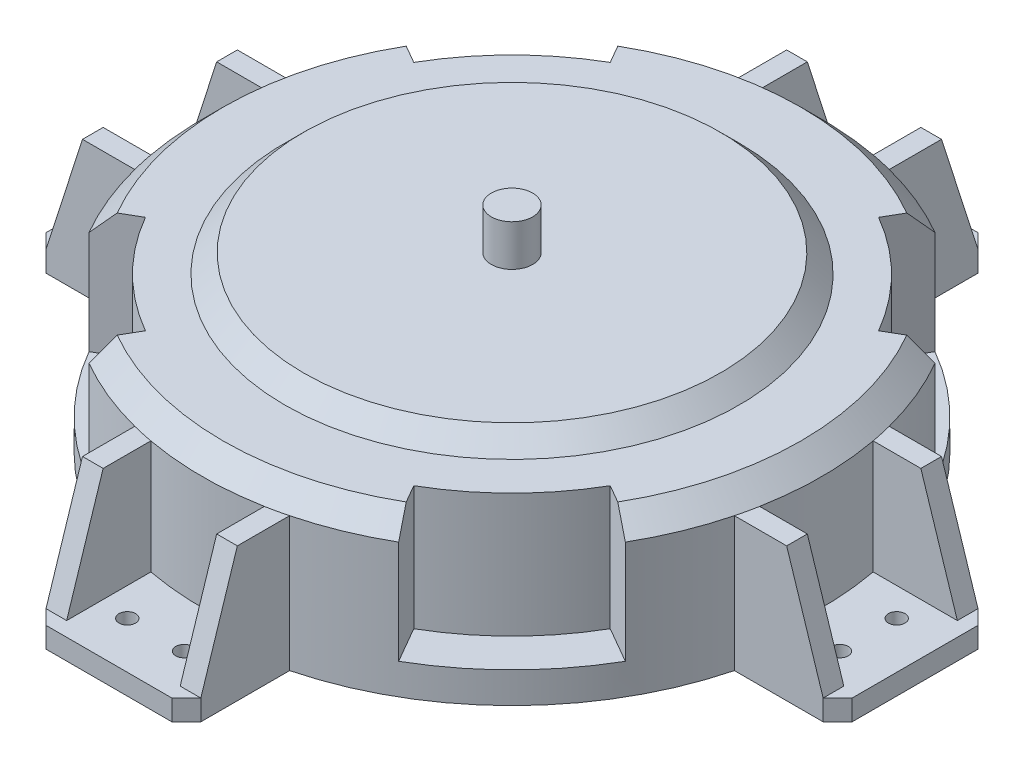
ISO-10303-21;
HEADER;
FILE_DESCRIPTION(('STEP AP214'),'2;1');
FILE_NAME('part.step','',(''),(''),'','','');
FILE_SCHEMA(('AUTOMOTIVE_DESIGN { 1 0 10303 214 1 1 1 1 }'));
ENDSEC;
DATA;
#1=APPLICATION_CONTEXT('core data for automotive mechanical design processes');
#2=APPLICATION_PROTOCOL_DEFINITION('international standard','automotive_design',2000,#1);
#3=PRODUCT_CONTEXT('',#1,'mechanical');
#4=PRODUCT('Part','Part','',(#3));
#5=PRODUCT_RELATED_PRODUCT_CATEGORY('part','',(#4));
#6=PRODUCT_DEFINITION_FORMATION('','',#4);
#7=PRODUCT_DEFINITION_CONTEXT('part definition',#1,'design');
#8=PRODUCT_DEFINITION('design','',#6,#7);
#9=PRODUCT_DEFINITION_SHAPE('','',#8);
#10=(LENGTH_UNIT() NAMED_UNIT(*) SI_UNIT(.MILLI.,.METRE.));
#11=(NAMED_UNIT(*) PLANE_ANGLE_UNIT() SI_UNIT($,.RADIAN.));
#12=(NAMED_UNIT(*) SI_UNIT($,.STERADIAN.) SOLID_ANGLE_UNIT());
#13=UNCERTAINTY_MEASURE_WITH_UNIT(LENGTH_MEASURE(1.E-05),#10,'distance_accuracy_value','');
#14=(GEOMETRIC_REPRESENTATION_CONTEXT(3) GLOBAL_UNCERTAINTY_ASSIGNED_CONTEXT((#13)) GLOBAL_UNIT_ASSIGNED_CONTEXT((#10,
#11,#12)) REPRESENTATION_CONTEXT('',''));
#15=CARTESIAN_POINT('',(0.,0.,0.));
#16=DIRECTION('',(0.,0.,1.));
#17=DIRECTION('',(1.,0.,0.));
#18=AXIS2_PLACEMENT_3D('',#15,#16,#17);
#19=CARTESIAN_POINT('',(0.,75.,0.));
#20=DIRECTION('',(0.,-1.,0.));
#21=DIRECTION('',(0.,0.,-1.));
#22=AXIS2_PLACEMENT_3D('',#19,#20,#21);
#23=CONICAL_SURFACE('',#22,140.,0.785398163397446);
#24=DIRECTION('',(-0.353553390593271,0.70710678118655,-0.612372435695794));
#25=VECTOR('',#24,1.);
#26=CARTESIAN_POINT('',(0.,215.000000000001,0.));
#27=LINE('',#26,#25);
#28=CARTESIAN_POINT('',(69.9999999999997,75.,121.243556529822));
#29=VERTEX_POINT('',#28);
#30=CARTESIAN_POINT('',(74.9999999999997,65.,129.903810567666));
#31=VERTEX_POINT('',#30);
#32=EDGE_CURVE('E11',#29,#31,#27,.F.);
#33=ORIENTED_EDGE('',*,*,#32,.F.);
#34=CARTESIAN_POINT('',(0.,75.,0.));
#35=DIRECTION('',(0.,1.,0.));
#36=DIRECTION('',(0.,0.,1.));
#37=AXIS2_PLACEMENT_3D('',#34,#35,#36);
#38=CIRCLE('',#37,140.);
#39=CARTESIAN_POINT('',(-70.0000000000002,75.,121.243556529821));
#40=VERTEX_POINT('',#39);
#41=EDGE_CURVE('E847',#40,#29,#38,.T.);
#42=ORIENTED_EDGE('',*,*,#41,.F.);
#43=DIRECTION('',(-0.353553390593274,-0.70710678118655,0.612372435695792));
#44=VECTOR('',#43,1.);
#45=CARTESIAN_POINT('',(0.,215.000000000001,0.));
#46=LINE('',#45,#44);
#47=CARTESIAN_POINT('',(-75.0000000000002,65.,129.903810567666));
#48=VERTEX_POINT('',#47);
#49=EDGE_CURVE('E949',#48,#40,#46,.F.);
#50=ORIENTED_EDGE('',*,*,#49,.F.);
#51=CARTESIAN_POINT('',(0.,65.,0.));
#52=DIRECTION('',(0.,1.,0.));
#53=DIRECTION('',(0.,0.,1.));
#54=AXIS2_PLACEMENT_3D('',#51,#52,#53);
#55=CIRCLE('',#54,150.);
#56=CARTESIAN_POINT('',(-37.4999999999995,65.,145.236875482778));
#57=VERTEX_POINT('',#56);
#58=EDGE_CURVE('E997',#57,#48,#55,.F.);
#59=ORIENTED_EDGE('',*,*,#58,.F.);
#60=CARTESIAN_POINT('',(-27.4999999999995,65.,147.457621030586));
#61=VERTEX_POINT('',#60);
#62=EDGE_CURVE('E1001',#61,#57,#55,.F.);
#63=ORIENTED_EDGE('',*,*,#62,.F.);
#64=CARTESIAN_POINT('',(27.5000000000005,65.,147.457621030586));
#65=VERTEX_POINT('',#64);
#66=EDGE_CURVE('E1010',#65,#61,#55,.F.);
#67=ORIENTED_EDGE('',*,*,#66,.F.);
#68=CARTESIAN_POINT('',(37.5000000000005,65.,145.236875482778));
#69=VERTEX_POINT('',#68);
#70=EDGE_CURVE('E1006',#69,#65,#55,.F.);
#71=ORIENTED_EDGE('',*,*,#70,.F.);
#72=EDGE_CURVE('E999',#31,#69,#55,.F.);
#73=ORIENTED_EDGE('',*,*,#72,.F.);
#74=EDGE_LOOP('',(#33,#42,#50,#59,#63,#67,#71,#73));
#75=FACE_BOUND('',#74,.T.);
#76=ADVANCED_FACE('F40',(#75),#23,.T.);
#77=DIRECTION('',(0.612372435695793,-0.707106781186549,0.353553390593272));
#78=VECTOR('',#77,1.);
#79=CARTESIAN_POINT('',(0.,215.000000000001,0.));
#80=LINE('',#79,#78);
#81=CARTESIAN_POINT('',(129.903810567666,65.,74.9999999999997));
#82=VERTEX_POINT('',#81);
#83=CARTESIAN_POINT('',(121.243556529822,75.,69.9999999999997));
#84=VERTEX_POINT('',#83);
#85=EDGE_CURVE('E49',#82,#84,#80,.F.);
#86=ORIENTED_EDGE('',*,*,#85,.F.);
#87=CARTESIAN_POINT('',(145.236875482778,65.,37.5));
#88=VERTEX_POINT('',#87);
#89=EDGE_CURVE('E466',#88,#82,#55,.F.);
#90=ORIENTED_EDGE('',*,*,#89,.F.);
#91=CARTESIAN_POINT('',(147.457621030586,65.,27.5));
#92=VERTEX_POINT('',#91);
#93=EDGE_CURVE('E1002',#92,#88,#55,.F.);
#94=ORIENTED_EDGE('',*,*,#93,.F.);
#95=CARTESIAN_POINT('',(147.457621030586,65.,-27.5));
#96=VERTEX_POINT('',#95);
#97=EDGE_CURVE('E1016',#96,#92,#55,.F.);
#98=ORIENTED_EDGE('',*,*,#97,.F.);
#99=CARTESIAN_POINT('',(145.236875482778,65.,-37.5));
#100=VERTEX_POINT('',#99);
#101=EDGE_CURVE('E1012',#100,#96,#55,.F.);
#102=ORIENTED_EDGE('',*,*,#101,.F.);
#103=CARTESIAN_POINT('',(129.903810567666,65.,-74.9999999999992));
#104=VERTEX_POINT('',#103);
#105=EDGE_CURVE('E1005',#104,#100,#55,.F.);
#106=ORIENTED_EDGE('',*,*,#105,.F.);
#107=DIRECTION('',(-0.612372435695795,0.70710678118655,0.353553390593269));
#108=VECTOR('',#107,1.);
#109=CARTESIAN_POINT('',(0.,215.000000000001,0.));
#110=LINE('',#109,#108);
#111=CARTESIAN_POINT('',(121.243556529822,75.,-69.9999999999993));
#112=VERTEX_POINT('',#111);
#113=EDGE_CURVE('E959',#112,#104,#110,.F.);
#114=ORIENTED_EDGE('',*,*,#113,.F.);
#115=EDGE_CURVE('E851',#84,#112,#38,.T.);
#116=ORIENTED_EDGE('',*,*,#115,.F.);
#117=EDGE_LOOP('',(#86,#90,#94,#98,#102,#106,#114,#116));
#118=FACE_BOUND('',#117,.T.);
#119=ADVANCED_FACE('F973',(#118),#23,.T.);
#120=DIRECTION('',(0.353553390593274,-0.70710678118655,-0.612372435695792));
#121=VECTOR('',#120,1.);
#122=CARTESIAN_POINT('',(0.,215.000000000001,0.));
#123=LINE('',#122,#121);
#124=CARTESIAN_POINT('',(75.0000000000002,65.,-129.903810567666));
#125=VERTEX_POINT('',#124);
#126=CARTESIAN_POINT('',(70.0000000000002,75.,-121.243556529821));
#127=VERTEX_POINT('',#126);
#128=EDGE_CURVE('E957',#125,#127,#123,.F.);
#129=ORIENTED_EDGE('',*,*,#128,.F.);
#130=CARTESIAN_POINT('',(37.4999999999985,65.,-145.236875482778));
#131=VERTEX_POINT('',#130);
#132=EDGE_CURVE('E998',#131,#125,#55,.F.);
#133=ORIENTED_EDGE('',*,*,#132,.F.);
#134=CARTESIAN_POINT('',(27.4999999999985,65.,-147.457621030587));
#135=VERTEX_POINT('',#134);
#136=EDGE_CURVE('E1004',#135,#131,#55,.F.);
#137=ORIENTED_EDGE('',*,*,#136,.F.);
#138=CARTESIAN_POINT('',(-27.5000000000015,65.,-147.457621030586));
#139=VERTEX_POINT('',#138);
#140=EDGE_CURVE('E1024',#139,#135,#55,.F.);
#141=ORIENTED_EDGE('',*,*,#140,.F.);
#142=CARTESIAN_POINT('',(-37.5000000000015,65.,-145.236875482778));
#143=VERTEX_POINT('',#142);
#144=EDGE_CURVE('E1017',#143,#139,#55,.F.);
#145=ORIENTED_EDGE('',*,*,#144,.F.);
#146=CARTESIAN_POINT('',(-75.0000000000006,64.9999999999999,-129.903810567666));
#147=VERTEX_POINT('',#146);
#148=EDGE_CURVE('E857',#147,#143,#55,.F.);
#149=ORIENTED_EDGE('',*,*,#148,.F.);
#150=DIRECTION('',(0.353553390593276,0.70710678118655,0.612372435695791));
#151=VECTOR('',#150,1.);
#152=CARTESIAN_POINT('',(0.,215.000000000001,0.));
#153=LINE('',#152,#151);
#154=CARTESIAN_POINT('',(-70.0000000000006,75.,-121.243556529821));
#155=VERTEX_POINT('',#154);
#156=EDGE_CURVE('E955',#155,#147,#153,.F.);
#157=ORIENTED_EDGE('',*,*,#156,.F.);
#158=EDGE_CURVE('E975',#127,#155,#38,.T.);
#159=ORIENTED_EDGE('',*,*,#158,.F.);
#160=EDGE_LOOP('',(#129,#133,#137,#141,#145,#149,#157,#159));
#161=FACE_BOUND('',#160,.T.);
#162=ADVANCED_FACE('F1143',(#161),#23,.T.);
#163=CARTESIAN_POINT('',(0.,75.,0.));
#164=DIRECTION('',(0.,-1.,0.));
#165=DIRECTION('',(0.,0.,-1.));
#166=AXIS2_PLACEMENT_3D('',#163,#164,#165);
#167=CYLINDRICAL_SURFACE('',#166,150.);
#168=DIRECTION('',(0.,-1.,0.));
#169=VECTOR('',#168,1.);
#170=CARTESIAN_POINT('',(27.4999999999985,75.,-147.457621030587));
#171=LINE('',#170,#169);
#172=CARTESIAN_POINT('',(27.4999999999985,10.,-147.457621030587));
#173=VERTEX_POINT('',#172);
#174=EDGE_CURVE('E582',#173,#135,#171,.F.);
#175=ORIENTED_EDGE('',*,*,#174,.F.);
#176=CARTESIAN_POINT('',(0.,10.,0.));
#177=DIRECTION('',(0.,-1.,0.));
#178=DIRECTION('',(-1.,0.,0.));
#179=AXIS2_PLACEMENT_3D('',#176,#177,#178);
#180=CIRCLE('',#179,150.);
#181=CARTESIAN_POINT('',(-27.5000000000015,10.,-147.457621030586));
#182=VERTEX_POINT('',#181);
#183=EDGE_CURVE('E716',#182,#173,#180,.T.);
#184=ORIENTED_EDGE('',*,*,#183,.F.);
#185=DIRECTION('',(0.,-1.,0.));
#186=VECTOR('',#185,1.);
#187=CARTESIAN_POINT('',(-27.5000000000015,75.,-147.457621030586));
#188=LINE('',#187,#186);
#189=EDGE_CURVE('E670',#139,#182,#188,.T.);
#190=ORIENTED_EDGE('',*,*,#189,.F.);
#191=ORIENTED_EDGE('',*,*,#140,.T.);
#192=EDGE_LOOP('',(#175,#184,#190,#191));
#193=FACE_BOUND('',#192,.T.);
#194=ADVANCED_FACE('F1113',(#193),#167,.T.);
#195=CARTESIAN_POINT('',(0.,10.,0.));
#196=DIRECTION('',(0.,1.,0.));
#197=DIRECTION('',(-1.,0.,0.));
#198=AXIS2_PLACEMENT_3D('',#195,#196,#197);
#199=PLANE('',#198);
#200=CARTESIAN_POINT('',(13.7499999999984,10.,-172.618437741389));
#201=DIRECTION('',(0.,-1.,0.));
#202=DIRECTION('',(1.,0.,0.));
#203=AXIS2_PLACEMENT_3D('',#200,#201,#202);
#204=CIRCLE('',#203,3.99999999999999);
#205=CARTESIAN_POINT('',(17.7499999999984,10.,-172.618437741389));
#206=VERTEX_POINT('',#205);
#207=EDGE_CURVE('E556',#206,#206,#204,.T.);
#208=ORIENTED_EDGE('',*,*,#207,.T.);
#209=EDGE_LOOP('',(#208));
#210=FACE_BOUND('',#209,.T.);
#211=CARTESIAN_POINT('',(-13.750000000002,10.,-172.618437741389));
#212=DIRECTION('',(0.,1.,0.));
#213=DIRECTION('',(-1.,0.,0.));
#214=AXIS2_PLACEMENT_3D('',#211,#212,#213);
#215=CIRCLE('',#214,3.99999999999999);
#216=CARTESIAN_POINT('',(-17.750000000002,10.,-172.618437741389));
#217=VERTEX_POINT('',#216);
#218=EDGE_CURVE('E637',#217,#217,#215,.T.);
#219=ORIENTED_EDGE('',*,*,#218,.F.);
#220=EDGE_LOOP('',(#219));
#221=FACE_BOUND('',#220,.T.);
#222=DIRECTION('',(0.,0.,-1.));
#223=VECTOR('',#222,1.);
#224=CARTESIAN_POINT('',(27.5,10.,-2.88047210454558E-13));
#225=LINE('',#224,#223);
#226=CARTESIAN_POINT('',(27.499999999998,10.,-188.236875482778));
#227=VERTEX_POINT('',#226);
#228=EDGE_CURVE('E947',#173,#227,#225,.T.);
#229=ORIENTED_EDGE('',*,*,#228,.T.);
#230=DIRECTION('',(1.,0.,0.));
#231=VECTOR('',#230,1.);
#232=CARTESIAN_POINT('',(27.499999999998,10.,-188.236875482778));
#233=LINE('',#232,#231);
#234=CARTESIAN_POINT('',(37.499999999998,10.,-188.236875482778));
#235=VERTEX_POINT('',#234);
#236=EDGE_CURVE('E575',#227,#235,#233,.T.);
#237=ORIENTED_EDGE('',*,*,#236,.T.);
#238=DIRECTION('',(0.707106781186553,0.,0.707106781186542));
#239=VECTOR('',#238,1.);
#240=CARTESIAN_POINT('',(112.868437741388,10.,-112.86843774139));
#241=LINE('',#240,#239);
#242=CARTESIAN_POINT('',(30.4999999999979,10.,-195.236875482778));
#243=VERTEX_POINT('',#242);
#244=EDGE_CURVE('E930',#235,#243,#241,.F.);
#245=ORIENTED_EDGE('',*,*,#244,.T.);
#246=DIRECTION('',(-1.,0.,0.));
#247=VECTOR('',#246,1.);
#248=CARTESIAN_POINT('',(-37.500000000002,10.,-195.236875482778));
#249=LINE('',#248,#247);
#250=CARTESIAN_POINT('',(-30.5000000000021,10.,-195.236875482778));
#251=VERTEX_POINT('',#250);
#252=EDGE_CURVE('E713',#243,#251,#249,.T.);
#253=ORIENTED_EDGE('',*,*,#252,.T.);
#254=DIRECTION('',(0.707106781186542,0.,-0.707106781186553));
#255=VECTOR('',#254,1.);
#256=CARTESIAN_POINT('',(-112.86843774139,10.,-112.868437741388));
#257=LINE('',#256,#255);
#258=CARTESIAN_POINT('',(-37.500000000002,10.,-188.236875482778));
#259=VERTEX_POINT('',#258);
#260=EDGE_CURVE('E932',#251,#259,#257,.F.);
#261=ORIENTED_EDGE('',*,*,#260,.T.);
#262=DIRECTION('',(-1.,0.,0.));
#263=VECTOR('',#262,1.);
#264=CARTESIAN_POINT('',(-27.500000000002,10.,-188.236875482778));
#265=LINE('',#264,#263);
#266=CARTESIAN_POINT('',(-27.500000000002,10.,-188.236875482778));
#267=VERTEX_POINT('',#266);
#268=EDGE_CURVE('E667',#267,#259,#265,.T.);
#269=ORIENTED_EDGE('',*,*,#268,.F.);
#270=DIRECTION('',(0.,0.,1.));
#271=VECTOR('',#270,1.);
#272=CARTESIAN_POINT('',(-27.5,10.,2.88047210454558E-13));
#273=LINE('',#272,#271);
#274=EDGE_CURVE('E941',#267,#182,#273,.T.);
#275=ORIENTED_EDGE('',*,*,#274,.T.);
#276=ORIENTED_EDGE('',*,*,#183,.T.);
#277=EDGE_LOOP('',(#229,#237,#245,#253,#261,#269,#275,#276));
#278=FACE_BOUND('',#277,.T.);
#279=ADVANCED_FACE('F1094',(#210,#221,#278),#199,.T.);
#280=DIRECTION('',(0.,-1.,0.));
#281=VECTOR('',#280,1.);
#282=CARTESIAN_POINT('',(147.457621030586,75.,27.5));
#283=LINE('',#282,#281);
#284=CARTESIAN_POINT('',(147.457621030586,10.,27.5));
#285=VERTEX_POINT('',#284);
#286=EDGE_CURVE('E607',#285,#92,#283,.F.);
#287=ORIENTED_EDGE('',*,*,#286,.F.);
#288=CARTESIAN_POINT('',(0.,10.,0.));
#289=DIRECTION('',(0.,-1.,0.));
#290=DIRECTION('',(0.,0.,-1.));
#291=AXIS2_PLACEMENT_3D('',#288,#289,#290);
#292=CIRCLE('',#291,150.);
#293=CARTESIAN_POINT('',(147.457621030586,10.,-27.5));
#294=VERTEX_POINT('',#293);
#295=EDGE_CURVE('E736',#294,#285,#292,.T.);
#296=ORIENTED_EDGE('',*,*,#295,.F.);
#297=DIRECTION('',(0.,-1.,0.));
#298=VECTOR('',#297,1.);
#299=CARTESIAN_POINT('',(147.457621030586,75.,-27.5));
#300=LINE('',#299,#298);
#301=EDGE_CURVE('E689',#96,#294,#300,.T.);
#302=ORIENTED_EDGE('',*,*,#301,.F.);
#303=ORIENTED_EDGE('',*,*,#97,.T.);
#304=EDGE_LOOP('',(#287,#296,#302,#303));
#305=FACE_BOUND('',#304,.T.);
#306=ADVANCED_FACE('F1052',(#305),#167,.T.);
#307=CARTESIAN_POINT('',(0.,10.,0.));
#308=DIRECTION('',(0.,1.,0.));
#309=DIRECTION('',(0.,0.,-1.));
#310=AXIS2_PLACEMENT_3D('',#307,#308,#309);
#311=PLANE('',#310);
#312=CARTESIAN_POINT('',(172.618437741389,10.,13.7500000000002));
#313=DIRECTION('',(0.,-1.,0.));
#314=DIRECTION('',(0.,0.,1.));
#315=AXIS2_PLACEMENT_3D('',#312,#313,#314);
#316=CIRCLE('',#315,3.99999999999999);
#317=CARTESIAN_POINT('',(172.618437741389,10.,17.7500000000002));
#318=VERTEX_POINT('',#317);
#319=EDGE_CURVE('E587',#318,#318,#316,.T.);
#320=ORIENTED_EDGE('',*,*,#319,.T.);
#321=EDGE_LOOP('',(#320));
#322=FACE_BOUND('',#321,.T.);
#323=CARTESIAN_POINT('',(172.618437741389,10.,-13.7500000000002));
#324=DIRECTION('',(0.,1.,0.));
#325=DIRECTION('',(0.,0.,-1.));
#326=AXIS2_PLACEMENT_3D('',#323,#324,#325);
#327=CIRCLE('',#326,3.99999999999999);
#328=CARTESIAN_POINT('',(172.618437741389,10.,-17.7500000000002));
#329=VERTEX_POINT('',#328);
#330=EDGE_CURVE('E648',#329,#329,#327,.T.);
#331=ORIENTED_EDGE('',*,*,#330,.F.);
#332=EDGE_LOOP('',(#331));
#333=FACE_BOUND('',#332,.T.);
#334=DIRECTION('',(1.,0.,0.));
#335=VECTOR('',#334,1.);
#336=CARTESIAN_POINT('',(0.,10.,27.5));
#337=LINE('',#336,#335);
#338=CARTESIAN_POINT('',(188.236875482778,10.,27.5));
#339=VERTEX_POINT('',#338);
#340=EDGE_CURVE('E945',#285,#339,#337,.T.);
#341=ORIENTED_EDGE('',*,*,#340,.T.);
#342=DIRECTION('',(0.,0.,1.));
#343=VECTOR('',#342,1.);
#344=CARTESIAN_POINT('',(188.236875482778,10.,27.5));
#345=LINE('',#344,#343);
#346=CARTESIAN_POINT('',(188.236875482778,10.,37.5));
#347=VERTEX_POINT('',#346);
#348=EDGE_CURVE('E600',#339,#347,#345,.T.);
#349=ORIENTED_EDGE('',*,*,#348,.T.);
#350=DIRECTION('',(-0.70710678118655,0.,0.707106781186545));
#351=VECTOR('',#350,1.);
#352=CARTESIAN_POINT('',(112.868437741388,10.,112.868437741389));
#353=LINE('',#352,#351);
#354=CARTESIAN_POINT('',(195.236875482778,10.,30.5));
#355=VERTEX_POINT('',#354);
#356=EDGE_CURVE('E911',#347,#355,#353,.F.);
#357=ORIENTED_EDGE('',*,*,#356,.T.);
#358=DIRECTION('',(0.,0.,-1.));
#359=VECTOR('',#358,1.);
#360=CARTESIAN_POINT('',(195.236875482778,10.,-37.5));
#361=LINE('',#360,#359);
#362=CARTESIAN_POINT('',(195.236875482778,10.,-30.5));
#363=VERTEX_POINT('',#362);
#364=EDGE_CURVE('E733',#355,#363,#361,.T.);
#365=ORIENTED_EDGE('',*,*,#364,.T.);
#366=DIRECTION('',(0.707106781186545,0.,0.70710678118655));
#367=VECTOR('',#366,1.);
#368=CARTESIAN_POINT('',(112.86843774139,10.,-112.868437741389));
#369=LINE('',#368,#367);
#370=CARTESIAN_POINT('',(188.236875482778,10.,-37.5));
#371=VERTEX_POINT('',#370);
#372=EDGE_CURVE('E913',#363,#371,#369,.F.);
#373=ORIENTED_EDGE('',*,*,#372,.T.);
#374=DIRECTION('',(0.,0.,-1.));
#375=VECTOR('',#374,1.);
#376=CARTESIAN_POINT('',(188.236875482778,10.,-27.5));
#377=LINE('',#376,#375);
#378=CARTESIAN_POINT('',(188.236875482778,10.,-27.5));
#379=VERTEX_POINT('',#378);
#380=EDGE_CURVE('E686',#379,#371,#377,.T.);
#381=ORIENTED_EDGE('',*,*,#380,.F.);
#382=DIRECTION('',(-1.,0.,0.));
#383=VECTOR('',#382,1.);
#384=CARTESIAN_POINT('',(0.,10.,-27.5));
#385=LINE('',#384,#383);
#386=EDGE_CURVE('E939',#379,#294,#385,.T.);
#387=ORIENTED_EDGE('',*,*,#386,.T.);
#388=ORIENTED_EDGE('',*,*,#295,.T.);
#389=EDGE_LOOP('',(#341,#349,#357,#365,#373,#381,#387,#388));
#390=FACE_BOUND('',#389,.T.);
#391=ADVANCED_FACE('F1054',(#322,#333,#390),#311,.T.);
#392=DIRECTION('',(0.,-1.,0.));
#393=VECTOR('',#392,1.);
#394=CARTESIAN_POINT('',(-27.4999999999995,75.,147.457621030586));
#395=LINE('',#394,#393);
#396=CARTESIAN_POINT('',(-27.4999999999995,10.,147.457621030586));
#397=VERTEX_POINT('',#396);
#398=EDGE_CURVE('E632',#397,#61,#395,.F.);
#399=ORIENTED_EDGE('',*,*,#398,.F.);
#400=CARTESIAN_POINT('',(0.,10.,0.));
#401=DIRECTION('',(0.,-1.,0.));
#402=DIRECTION('',(1.,0.,0.));
#403=AXIS2_PLACEMENT_3D('',#400,#401,#402);
#404=CIRCLE('',#403,150.);
#405=CARTESIAN_POINT('',(27.5000000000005,10.,147.457621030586));
#406=VERTEX_POINT('',#405);
#407=EDGE_CURVE('E756',#406,#397,#404,.T.);
#408=ORIENTED_EDGE('',*,*,#407,.F.);
#409=DIRECTION('',(0.,-1.,0.));
#410=VECTOR('',#409,1.);
#411=CARTESIAN_POINT('',(27.5000000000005,75.,147.457621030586));
#412=LINE('',#411,#410);
#413=EDGE_CURVE('E708',#65,#406,#412,.T.);
#414=ORIENTED_EDGE('',*,*,#413,.F.);
#415=ORIENTED_EDGE('',*,*,#66,.T.);
#416=EDGE_LOOP('',(#399,#408,#414,#415));
#417=FACE_BOUND('',#416,.T.);
#418=ADVANCED_FACE('F1296',(#417),#167,.T.);
#419=CARTESIAN_POINT('',(0.,10.,0.));
#420=DIRECTION('',(0.,1.,0.));
#421=DIRECTION('',(1.,0.,0.));
#422=AXIS2_PLACEMENT_3D('',#419,#420,#421);
#423=PLANE('',#422);
#424=CARTESIAN_POINT('',(-13.7499999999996,10.,172.618437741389));
#425=DIRECTION('',(0.,-1.,0.));
#426=DIRECTION('',(-1.,0.,0.));
#427=AXIS2_PLACEMENT_3D('',#424,#425,#426);
#428=CIRCLE('',#427,3.99999999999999);
#429=CARTESIAN_POINT('',(-17.7499999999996,10.,172.618437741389));
#430=VERTEX_POINT('',#429);
#431=EDGE_CURVE('E612',#430,#430,#428,.T.);
#432=ORIENTED_EDGE('',*,*,#431,.T.);
#433=EDGE_LOOP('',(#432));
#434=FACE_BOUND('',#433,.T.);
#435=CARTESIAN_POINT('',(13.7500000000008,10.,172.618437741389));
#436=DIRECTION('',(0.,1.,0.));
#437=DIRECTION('',(1.,0.,0.));
#438=AXIS2_PLACEMENT_3D('',#435,#436,#437);
#439=CIRCLE('',#438,3.99999999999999);
#440=CARTESIAN_POINT('',(17.7500000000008,10.,172.618437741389));
#441=VERTEX_POINT('',#440);
#442=EDGE_CURVE('E642',#441,#441,#439,.T.);
#443=ORIENTED_EDGE('',*,*,#442,.F.);
#444=EDGE_LOOP('',(#443));
#445=FACE_BOUND('',#444,.T.);
#446=DIRECTION('',(0.,0.,1.));
#447=VECTOR('',#446,1.);
#448=CARTESIAN_POINT('',(-27.5,10.,0.));
#449=LINE('',#448,#447);
#450=CARTESIAN_POINT('',(-27.4999999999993,10.,188.236875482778));
#451=VERTEX_POINT('',#450);
#452=EDGE_CURVE('E943',#397,#451,#449,.T.);
#453=ORIENTED_EDGE('',*,*,#452,.T.);
#454=DIRECTION('',(-1.,0.,0.));
#455=VECTOR('',#454,1.);
#456=CARTESIAN_POINT('',(-27.4999999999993,10.,188.236875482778));
#457=LINE('',#456,#455);
#458=CARTESIAN_POINT('',(-37.4999999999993,10.,188.236875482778));
#459=VERTEX_POINT('',#458);
#460=EDGE_CURVE('E625',#451,#459,#457,.T.);
#461=ORIENTED_EDGE('',*,*,#460,.T.);
#462=DIRECTION('',(-0.707106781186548,0.,-0.707106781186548));
#463=VECTOR('',#462,1.);
#464=CARTESIAN_POINT('',(-112.868437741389,10.,112.868437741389));
#465=LINE('',#464,#463);
#466=CARTESIAN_POINT('',(-30.4999999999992,10.,195.236875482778));
#467=VERTEX_POINT('',#466);
#468=EDGE_CURVE('E892',#459,#467,#465,.F.);
#469=ORIENTED_EDGE('',*,*,#468,.T.);
#470=DIRECTION('',(1.,0.,0.));
#471=VECTOR('',#470,1.);
#472=CARTESIAN_POINT('',(37.5000000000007,10.,195.236875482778));
#473=LINE('',#472,#471);
#474=CARTESIAN_POINT('',(30.5000000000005,10.,195.236875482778));
#475=VERTEX_POINT('',#474);
#476=EDGE_CURVE('E753',#467,#475,#473,.T.);
#477=ORIENTED_EDGE('',*,*,#476,.T.);
#478=DIRECTION('',(-0.707106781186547,0.,0.707106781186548));
#479=VECTOR('',#478,1.);
#480=CARTESIAN_POINT('',(112.868437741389,10.,112.868437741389));
#481=LINE('',#480,#479);
#482=CARTESIAN_POINT('',(37.5000000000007,10.,188.236875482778));
#483=VERTEX_POINT('',#482);
#484=EDGE_CURVE('E894',#475,#483,#481,.F.);
#485=ORIENTED_EDGE('',*,*,#484,.T.);
#486=DIRECTION('',(1.,0.,0.));
#487=VECTOR('',#486,1.);
#488=CARTESIAN_POINT('',(27.5000000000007,10.,188.236875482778));
#489=LINE('',#488,#487);
#490=CARTESIAN_POINT('',(27.5000000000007,10.,188.236875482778));
#491=VERTEX_POINT('',#490);
#492=EDGE_CURVE('E705',#491,#483,#489,.T.);
#493=ORIENTED_EDGE('',*,*,#492,.F.);
#494=DIRECTION('',(0.,0.,-1.));
#495=VECTOR('',#494,1.);
#496=CARTESIAN_POINT('',(27.5,10.,0.));
#497=LINE('',#496,#495);
#498=EDGE_CURVE('E937',#491,#406,#497,.T.);
#499=ORIENTED_EDGE('',*,*,#498,.T.);
#500=ORIENTED_EDGE('',*,*,#407,.T.);
#501=EDGE_LOOP('',(#453,#461,#469,#477,#485,#493,#499,#500));
#502=FACE_BOUND('',#501,.T.);
#503=ADVANCED_FACE('F1307',(#434,#445,#502),#423,.T.);
#504=CARTESIAN_POINT('',(0.,15.,0.));
#505=DIRECTION('',(0.,1.,0.));
#506=DIRECTION('',(0.,0.,-1.));
#507=AXIS2_PLACEMENT_3D('',#504,#505,#506);
#508=CIRCLE('',#507,150.);
#509=CARTESIAN_POINT('',(129.903810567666,15.,-74.9999999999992));
#510=VERTEX_POINT('',#509);
#511=CARTESIAN_POINT('',(75.0000000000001,15.,-129.903810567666));
#512=VERTEX_POINT('',#511);
#513=EDGE_CURVE('E473',#510,#512,#508,.T.);
#514=ORIENTED_EDGE('',*,*,#513,.F.);
#515=DIRECTION('',(0.,1.,0.));
#516=VECTOR('',#515,1.);
#517=CARTESIAN_POINT('',(129.903810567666,15.,-74.9999999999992));
#518=LINE('',#517,#516);
#519=EDGE_CURVE('E493',#510,#104,#518,.T.);
#520=ORIENTED_EDGE('',*,*,#519,.T.);
#521=ORIENTED_EDGE('',*,*,#105,.T.);
#522=DIRECTION('',(0.,-1.,0.));
#523=VECTOR('',#522,1.);
#524=CARTESIAN_POINT('',(145.236875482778,10.,-37.5));
#525=LINE('',#524,#523);
#526=CARTESIAN_POINT('',(145.236875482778,0.,-37.5));
#527=VERTEX_POINT('',#526);
#528=EDGE_CURVE('E749',#100,#527,#525,.T.);
#529=ORIENTED_EDGE('',*,*,#528,.T.);
#530=CARTESIAN_POINT('',(0.,0.,0.));
#531=DIRECTION('',(0.,1.,0.));
#532=DIRECTION('',(0.,0.,1.));
#533=AXIS2_PLACEMENT_3D('',#530,#531,#532);
#534=CIRCLE('',#533,150.);
#535=CARTESIAN_POINT('',(37.4999999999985,0.,-145.236875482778));
#536=VERTEX_POINT('',#535);
#537=EDGE_CURVE('E1074',#527,#536,#534,.T.);
#538=ORIENTED_EDGE('',*,*,#537,.T.);
#539=DIRECTION('',(0.,-1.,0.));
#540=VECTOR('',#539,1.);
#541=CARTESIAN_POINT('',(37.4999999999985,10.,-145.236875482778));
#542=LINE('',#541,#540);
#543=EDGE_CURVE('E720',#131,#536,#542,.T.);
#544=ORIENTED_EDGE('',*,*,#543,.F.);
#545=ORIENTED_EDGE('',*,*,#132,.T.);
#546=DIRECTION('',(0.,1.,0.));
#547=VECTOR('',#546,1.);
#548=CARTESIAN_POINT('',(75.0000000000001,15.,-129.903810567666));
#549=LINE('',#548,#547);
#550=EDGE_CURVE('E64',#512,#125,#549,.T.);
#551=ORIENTED_EDGE('',*,*,#550,.F.);
#552=EDGE_LOOP('',(#514,#520,#521,#529,#538,#544,#545,#551));
#553=FACE_BOUND('',#552,.T.);
#554=ADVANCED_FACE('F1073',(#553),#167,.T.);
#555=CARTESIAN_POINT('',(0.,15.,0.));
#556=DIRECTION('',(0.,1.,0.));
#557=DIRECTION('',(1.,0.,0.));
#558=AXIS2_PLACEMENT_3D('',#555,#556,#557);
#559=CIRCLE('',#558,150.);
#560=CARTESIAN_POINT('',(74.9999999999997,15.,129.903810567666));
#561=VERTEX_POINT('',#560);
#562=CARTESIAN_POINT('',(129.903810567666,15.,74.9999999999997));
#563=VERTEX_POINT('',#562);
#564=EDGE_CURVE('E452',#561,#563,#559,.T.);
#565=ORIENTED_EDGE('',*,*,#564,.F.);
#566=DIRECTION('',(0.,1.,0.));
#567=VECTOR('',#566,1.);
#568=CARTESIAN_POINT('',(74.9999999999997,15.,129.903810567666));
#569=LINE('',#568,#567);
#570=EDGE_CURVE('E548',#561,#31,#569,.T.);
#571=ORIENTED_EDGE('',*,*,#570,.T.);
#572=ORIENTED_EDGE('',*,*,#72,.T.);
#573=DIRECTION('',(0.,-1.,0.));
#574=VECTOR('',#573,1.);
#575=CARTESIAN_POINT('',(37.5000000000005,10.,145.236875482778));
#576=LINE('',#575,#574);
#577=CARTESIAN_POINT('',(37.5000000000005,0.,145.236875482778));
#578=VERTEX_POINT('',#577);
#579=EDGE_CURVE('E769',#69,#578,#576,.T.);
#580=ORIENTED_EDGE('',*,*,#579,.T.);
#581=CARTESIAN_POINT('',(145.236875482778,0.,37.5));
#582=VERTEX_POINT('',#581);
#583=EDGE_CURVE('E846',#578,#582,#534,.T.);
#584=ORIENTED_EDGE('',*,*,#583,.T.);
#585=DIRECTION('',(0.,-1.,0.));
#586=VECTOR('',#585,1.);
#587=CARTESIAN_POINT('',(145.236875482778,10.,37.5));
#588=LINE('',#587,#586);
#589=EDGE_CURVE('E740',#88,#582,#588,.T.);
#590=ORIENTED_EDGE('',*,*,#589,.F.);
#591=ORIENTED_EDGE('',*,*,#89,.T.);
#592=DIRECTION('',(0.,1.,0.));
#593=VECTOR('',#592,1.);
#594=CARTESIAN_POINT('',(129.903810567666,15.,74.9999999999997));
#595=LINE('',#594,#593);
#596=EDGE_CURVE('E444',#563,#82,#595,.T.);
#597=ORIENTED_EDGE('',*,*,#596,.F.);
#598=EDGE_LOOP('',(#565,#571,#572,#580,#584,#590,#591,#597));
#599=FACE_BOUND('',#598,.T.);
#600=ADVANCED_FACE('F464',(#599),#167,.T.);
#601=CARTESIAN_POINT('',(0.,15.,0.));
#602=DIRECTION('',(0.,1.,0.));
#603=DIRECTION('',(0.,0.,1.));
#604=AXIS2_PLACEMENT_3D('',#601,#602,#603);
#605=CIRCLE('',#604,150.);
#606=CARTESIAN_POINT('',(-129.903810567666,15.,74.9999999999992));
#607=VERTEX_POINT('',#606);
#608=CARTESIAN_POINT('',(-75.0000000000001,15.,129.903810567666));
#609=VERTEX_POINT('',#608);
#610=EDGE_CURVE('E531',#607,#609,#605,.T.);
#611=ORIENTED_EDGE('',*,*,#610,.F.);
#612=DIRECTION('',(0.,1.,0.));
#613=VECTOR('',#612,1.);
#614=CARTESIAN_POINT('',(-129.903810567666,15.,74.9999999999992));
#615=LINE('',#614,#613);
#616=CARTESIAN_POINT('',(-129.903810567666,65.,74.9999999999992));
#617=VERTEX_POINT('',#616);
#618=EDGE_CURVE('E553',#607,#617,#615,.T.);
#619=ORIENTED_EDGE('',*,*,#618,.T.);
#620=CARTESIAN_POINT('',(-145.236875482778,65.,37.5));
#621=VERTEX_POINT('',#620);
#622=EDGE_CURVE('E850',#617,#621,#55,.F.);
#623=ORIENTED_EDGE('',*,*,#622,.T.);
#624=DIRECTION('',(0.,-1.,0.));
#625=VECTOR('',#624,1.);
#626=CARTESIAN_POINT('',(-145.236875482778,10.,37.5));
#627=LINE('',#626,#625);
#628=CARTESIAN_POINT('',(-145.236875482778,0.,37.5));
#629=VERTEX_POINT('',#628);
#630=EDGE_CURVE('E839',#621,#629,#627,.T.);
#631=ORIENTED_EDGE('',*,*,#630,.T.);
#632=CARTESIAN_POINT('',(-37.4999999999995,0.,145.236875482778));
#633=VERTEX_POINT('',#632);
#634=EDGE_CURVE('E843',#629,#633,#534,.T.);
#635=ORIENTED_EDGE('',*,*,#634,.T.);
#636=DIRECTION('',(0.,-1.,0.));
#637=VECTOR('',#636,1.);
#638=CARTESIAN_POINT('',(-37.4999999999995,10.,145.236875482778));
#639=LINE('',#638,#637);
#640=EDGE_CURVE('E760',#57,#633,#639,.T.);
#641=ORIENTED_EDGE('',*,*,#640,.F.);
#642=ORIENTED_EDGE('',*,*,#58,.T.);
#643=DIRECTION('',(0.,1.,0.));
#644=VECTOR('',#643,1.);
#645=CARTESIAN_POINT('',(-75.0000000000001,15.,129.903810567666));
#646=LINE('',#645,#644);
#647=EDGE_CURVE('E544',#609,#48,#646,.T.);
#648=ORIENTED_EDGE('',*,*,#647,.F.);
#649=EDGE_LOOP('',(#611,#619,#623,#631,#635,#641,#642,#648));
#650=FACE_BOUND('',#649,.T.);
#651=ADVANCED_FACE('F1371',(#650),#167,.T.);
#652=CARTESIAN_POINT('',(0.,15.,0.));
#653=DIRECTION('',(0.,1.,0.));
#654=DIRECTION('',(-1.,0.,0.));
#655=AXIS2_PLACEMENT_3D('',#652,#653,#654);
#656=CIRCLE('',#655,150.);
#657=CARTESIAN_POINT('',(-75.0000000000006,15.,-129.903810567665));
#658=VERTEX_POINT('',#657);
#659=CARTESIAN_POINT('',(-129.903810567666,15.,-74.9999999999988));
#660=VERTEX_POINT('',#659);
#661=EDGE_CURVE('E503',#658,#660,#656,.T.);
#662=ORIENTED_EDGE('',*,*,#661,.F.);
#663=DIRECTION('',(0.,1.,0.));
#664=VECTOR('',#663,1.);
#665=CARTESIAN_POINT('',(-75.0000000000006,15.,-129.903810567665));
#666=LINE('',#665,#664);
#667=EDGE_CURVE('E489',#658,#147,#666,.T.);
#668=ORIENTED_EDGE('',*,*,#667,.T.);
#669=ORIENTED_EDGE('',*,*,#148,.T.);
#670=DIRECTION('',(0.,-1.,0.));
#671=VECTOR('',#670,1.);
#672=CARTESIAN_POINT('',(-37.5000000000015,10.,-145.236875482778));
#673=LINE('',#672,#671);
#674=CARTESIAN_POINT('',(-37.5000000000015,0.,-145.236875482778));
#675=VERTEX_POINT('',#674);
#676=EDGE_CURVE('E729',#143,#675,#673,.T.);
#677=ORIENTED_EDGE('',*,*,#676,.T.);
#678=CARTESIAN_POINT('',(-145.236875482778,0.,-37.5));
#679=VERTEX_POINT('',#678);
#680=EDGE_CURVE('E842',#675,#679,#534,.T.);
#681=ORIENTED_EDGE('',*,*,#680,.T.);
#682=DIRECTION('',(0.,-1.,0.));
#683=VECTOR('',#682,1.);
#684=CARTESIAN_POINT('',(-145.236875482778,10.,-37.5));
#685=LINE('',#684,#683);
#686=CARTESIAN_POINT('',(-145.236875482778,65.,-37.5));
#687=VERTEX_POINT('',#686);
#688=EDGE_CURVE('E830',#687,#679,#685,.T.);
#689=ORIENTED_EDGE('',*,*,#688,.F.);
#690=CARTESIAN_POINT('',(-129.903810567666,65.,-74.9999999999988));
#691=VERTEX_POINT('',#690);
#692=EDGE_CURVE('E1011',#687,#691,#55,.F.);
#693=ORIENTED_EDGE('',*,*,#692,.T.);
#694=DIRECTION('',(0.,1.,0.));
#695=VECTOR('',#694,1.);
#696=CARTESIAN_POINT('',(-129.903810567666,15.,-74.9999999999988));
#697=LINE('',#696,#695);
#698=EDGE_CURVE('E56',#660,#691,#697,.T.);
#699=ORIENTED_EDGE('',*,*,#698,.F.);
#700=EDGE_LOOP('',(#662,#668,#669,#677,#681,#689,#693,#699));
#701=FACE_BOUND('',#700,.T.);
#702=ADVANCED_FACE('F1164',(#701),#167,.T.);
#703=DIRECTION('',(0.,-1.,0.));
#704=VECTOR('',#703,1.);
#705=CARTESIAN_POINT('',(-147.457621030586,75.,-27.5));
#706=LINE('',#705,#704);
#707=CARTESIAN_POINT('',(-147.457621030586,10.,-27.5));
#708=VERTEX_POINT('',#707);
#709=CARTESIAN_POINT('',(-147.457621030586,65.,-27.5));
#710=VERTEX_POINT('',#709);
#711=EDGE_CURVE('E792',#708,#710,#706,.F.);
#712=ORIENTED_EDGE('',*,*,#711,.F.);
#713=CARTESIAN_POINT('',(0.,10.,0.));
#714=DIRECTION('',(0.,-1.,0.));
#715=DIRECTION('',(0.,0.,1.));
#716=AXIS2_PLACEMENT_3D('',#713,#714,#715);
#717=CIRCLE('',#716,150.);
#718=CARTESIAN_POINT('',(-147.457621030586,10.,27.5));
#719=VERTEX_POINT('',#718);
#720=EDGE_CURVE('E826',#719,#708,#717,.T.);
#721=ORIENTED_EDGE('',*,*,#720,.F.);
#722=DIRECTION('',(0.,-1.,0.));
#723=VECTOR('',#722,1.);
#724=CARTESIAN_POINT('',(-147.457621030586,75.,27.5));
#725=LINE('',#724,#723);
#726=CARTESIAN_POINT('',(-147.457621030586,65.,27.5));
#727=VERTEX_POINT('',#726);
#728=EDGE_CURVE('E818',#727,#719,#725,.T.);
#729=ORIENTED_EDGE('',*,*,#728,.F.);
#730=EDGE_CURVE('E856',#727,#710,#55,.F.);
#731=ORIENTED_EDGE('',*,*,#730,.T.);
#732=EDGE_LOOP('',(#712,#721,#729,#731));
#733=FACE_BOUND('',#732,.T.);
#734=ADVANCED_FACE('F1358',(#733),#167,.T.);
#735=CARTESIAN_POINT('',(0.,10.,0.));
#736=DIRECTION('',(0.,1.,0.));
#737=DIRECTION('',(0.,0.,1.));
#738=AXIS2_PLACEMENT_3D('',#735,#736,#737);
#739=PLANE('',#738);
#740=CARTESIAN_POINT('',(-172.618437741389,10.,-13.7500000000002));
#741=DIRECTION('',(0.,-1.,0.));
#742=DIRECTION('',(0.,0.,-1.));
#743=AXIS2_PLACEMENT_3D('',#740,#741,#742);
#744=CIRCLE('',#743,3.99999999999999);
#745=CARTESIAN_POINT('',(-172.618437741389,10.,-17.7500000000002));
#746=VERTEX_POINT('',#745);
#747=EDGE_CURVE('E772',#746,#746,#744,.T.);
#748=ORIENTED_EDGE('',*,*,#747,.T.);
#749=EDGE_LOOP('',(#748));
#750=FACE_BOUND('',#749,.T.);
#751=CARTESIAN_POINT('',(-172.618437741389,10.,13.7500000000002));
#752=DIRECTION('',(0.,1.,0.));
#753=DIRECTION('',(0.,0.,1.));
#754=AXIS2_PLACEMENT_3D('',#751,#752,#753);
#755=CIRCLE('',#754,3.99999999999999);
#756=CARTESIAN_POINT('',(-172.618437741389,10.,17.7500000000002));
#757=VERTEX_POINT('',#756);
#758=EDGE_CURVE('E797',#757,#757,#755,.T.);
#759=ORIENTED_EDGE('',*,*,#758,.F.);
#760=EDGE_LOOP('',(#759));
#761=FACE_BOUND('',#760,.T.);
#762=DIRECTION('',(-1.,0.,0.));
#763=VECTOR('',#762,1.);
#764=CARTESIAN_POINT('',(0.,10.,-27.5));
#765=LINE('',#764,#763);
#766=CARTESIAN_POINT('',(-188.236875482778,10.,-27.5));
#767=VERTEX_POINT('',#766);
#768=EDGE_CURVE('E878',#708,#767,#765,.T.);
#769=ORIENTED_EDGE('',*,*,#768,.T.);
#770=DIRECTION('',(0.,0.,-1.));
#771=VECTOR('',#770,1.);
#772=CARTESIAN_POINT('',(-188.236875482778,10.,-27.5));
#773=LINE('',#772,#771);
#774=CARTESIAN_POINT('',(-188.236875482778,10.,-37.5));
#775=VERTEX_POINT('',#774);
#776=EDGE_CURVE('E785',#767,#775,#773,.T.);
#777=ORIENTED_EDGE('',*,*,#776,.T.);
#778=DIRECTION('',(0.70710678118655,0.,-0.707106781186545));
#779=VECTOR('',#778,1.);
#780=CARTESIAN_POINT('',(-112.868437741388,10.,-112.868437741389));
#781=LINE('',#780,#779);
#782=CARTESIAN_POINT('',(-195.236875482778,10.,-30.5));
#783=VERTEX_POINT('',#782);
#784=EDGE_CURVE('E869',#775,#783,#781,.F.);
#785=ORIENTED_EDGE('',*,*,#784,.T.);
#786=DIRECTION('',(0.,0.,1.));
#787=VECTOR('',#786,1.);
#788=CARTESIAN_POINT('',(-195.236875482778,10.,37.5));
#789=LINE('',#788,#787);
#790=CARTESIAN_POINT('',(-195.236875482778,10.,30.4999999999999));
#791=VERTEX_POINT('',#790);
#792=EDGE_CURVE('E823',#783,#791,#789,.T.);
#793=ORIENTED_EDGE('',*,*,#792,.T.);
#794=DIRECTION('',(-0.707106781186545,0.,-0.70710678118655));
#795=VECTOR('',#794,1.);
#796=CARTESIAN_POINT('',(-112.86843774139,10.,112.868437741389));
#797=LINE('',#796,#795);
#798=CARTESIAN_POINT('',(-188.236875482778,10.,37.5));
#799=VERTEX_POINT('',#798);
#800=EDGE_CURVE('E871',#791,#799,#797,.F.);
#801=ORIENTED_EDGE('',*,*,#800,.T.);
#802=DIRECTION('',(0.,0.,1.));
#803=VECTOR('',#802,1.);
#804=CARTESIAN_POINT('',(-188.236875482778,10.,27.5));
#805=LINE('',#804,#803);
#806=CARTESIAN_POINT('',(-188.236875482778,10.,27.5));
#807=VERTEX_POINT('',#806);
#808=EDGE_CURVE('E815',#807,#799,#805,.T.);
#809=ORIENTED_EDGE('',*,*,#808,.F.);
#810=DIRECTION('',(1.,0.,0.));
#811=VECTOR('',#810,1.);
#812=CARTESIAN_POINT('',(0.,10.,27.5));
#813=LINE('',#812,#811);
#814=EDGE_CURVE('E876',#807,#719,#813,.T.);
#815=ORIENTED_EDGE('',*,*,#814,.T.);
#816=ORIENTED_EDGE('',*,*,#720,.T.);
#817=EDGE_LOOP('',(#769,#777,#785,#793,#801,#809,#815,#816));
#818=FACE_BOUND('',#817,.T.);
#819=ADVANCED_FACE('F1355',(#750,#761,#818),#739,.T.);
#820=CARTESIAN_POINT('',(0.,75.,0.));
#821=DIRECTION('',(0.,1.,0.));
#822=DIRECTION('',(0.,0.,1.));
#823=AXIS2_PLACEMENT_3D('',#820,#821,#822);
#824=PLANE('',#823);
#825=CARTESIAN_POINT('',(0.,75.,0.));
#826=DIRECTION('',(0.,1.,0.));
#827=DIRECTION('',(0.,0.,1.));
#828=AXIS2_PLACEMENT_3D('',#825,#826,#827);
#829=CIRCLE('',#828,110.);
#830=CARTESIAN_POINT('',(0.,75.,110.));
#831=VERTEX_POINT('',#830);
#832=EDGE_CURVE('E1457',#831,#831,#829,.T.);
#833=ORIENTED_EDGE('',*,*,#832,.F.);
#834=EDGE_LOOP('',(#833));
#835=FACE_BOUND('',#834,.T.);
#836=DIRECTION('',(0.499999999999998,0.,0.86602540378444));
#837=VECTOR('',#836,1.);
#838=CARTESIAN_POINT('',(64.9999999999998,75.,112.583302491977));
#839=LINE('',#838,#837);
#840=CARTESIAN_POINT('',(64.9999999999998,75.,112.583302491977));
#841=VERTEX_POINT('',#840);
#842=EDGE_CURVE('E461',#841,#29,#839,.T.);
#843=ORIENTED_EDGE('',*,*,#842,.F.);
#844=CARTESIAN_POINT('',(0.,75.,0.));
#845=DIRECTION('',(0.,-1.,0.));
#846=DIRECTION('',(1.,0.,0.));
#847=AXIS2_PLACEMENT_3D('',#844,#845,#846);
#848=CIRCLE('',#847,130.);
#849=CARTESIAN_POINT('',(112.583302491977,75.,64.9999999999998));
#850=VERTEX_POINT('',#849);
#851=EDGE_CURVE('E970',#850,#841,#848,.T.);
#852=ORIENTED_EDGE('',*,*,#851,.F.);
#853=DIRECTION('',(-0.86602540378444,0.,-0.499999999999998));
#854=VECTOR('',#853,1.);
#855=CARTESIAN_POINT('',(112.583302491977,75.,64.9999999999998));
#856=LINE('',#855,#854);
#857=EDGE_CURVE('E496',#84,#850,#856,.T.);
#858=ORIENTED_EDGE('',*,*,#857,.F.);
#859=ORIENTED_EDGE('',*,*,#115,.T.);
#860=DIRECTION('',(0.866025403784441,0.,-0.499999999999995));
#861=VECTOR('',#860,1.);
#862=CARTESIAN_POINT('',(112.583302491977,75.,-64.9999999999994));
#863=LINE('',#862,#861);
#864=CARTESIAN_POINT('',(112.583302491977,75.,-64.9999999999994));
#865=VERTEX_POINT('',#864);
#866=EDGE_CURVE('E477',#865,#112,#863,.T.);
#867=ORIENTED_EDGE('',*,*,#866,.F.);
#868=CARTESIAN_POINT('',(0.,75.,0.));
#869=DIRECTION('',(0.,-1.,0.));
#870=DIRECTION('',(0.,0.,-1.));
#871=AXIS2_PLACEMENT_3D('',#868,#869,#870);
#872=CIRCLE('',#871,130.);
#873=CARTESIAN_POINT('',(65.0000000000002,75.,-112.583302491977));
#874=VERTEX_POINT('',#873);
#875=EDGE_CURVE('E488',#874,#865,#872,.T.);
#876=ORIENTED_EDGE('',*,*,#875,.F.);
#877=DIRECTION('',(-0.500000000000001,0.,0.866025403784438));
#878=VECTOR('',#877,1.);
#879=CARTESIAN_POINT('',(65.0000000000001,75.,-112.583302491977));
#880=LINE('',#879,#878);
#881=EDGE_CURVE('E486',#127,#874,#880,.T.);
#882=ORIENTED_EDGE('',*,*,#881,.F.);
#883=ORIENTED_EDGE('',*,*,#158,.T.);
#884=DIRECTION('',(-0.500000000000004,0.,-0.866025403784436));
#885=VECTOR('',#884,1.);
#886=CARTESIAN_POINT('',(-65.0000000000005,75.,-112.583302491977));
#887=LINE('',#886,#885);
#888=CARTESIAN_POINT('',(-65.0000000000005,75.,-112.583302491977));
#889=VERTEX_POINT('',#888);
#890=EDGE_CURVE('E507',#889,#155,#887,.T.);
#891=ORIENTED_EDGE('',*,*,#890,.F.);
#892=CARTESIAN_POINT('',(0.,75.,0.));
#893=DIRECTION('',(0.,-1.,0.));
#894=DIRECTION('',(-1.,0.,0.));
#895=AXIS2_PLACEMENT_3D('',#892,#893,#894);
#896=CIRCLE('',#895,130.);
#897=CARTESIAN_POINT('',(-112.583302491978,75.,-64.999999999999));
#898=VERTEX_POINT('',#897);
#899=EDGE_CURVE('E518',#898,#889,#896,.T.);
#900=ORIENTED_EDGE('',*,*,#899,.F.);
#901=DIRECTION('',(0.866025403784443,0.,0.499999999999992));
#902=VECTOR('',#901,1.);
#903=CARTESIAN_POINT('',(-112.583302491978,75.,-64.999999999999));
#904=LINE('',#903,#902);
#905=CARTESIAN_POINT('',(-121.243556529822,75.,-69.9999999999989));
#906=VERTEX_POINT('',#905);
#907=EDGE_CURVE('E516',#906,#898,#904,.T.);
#908=ORIENTED_EDGE('',*,*,#907,.F.);
#909=CARTESIAN_POINT('',(-121.243556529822,75.,69.9999999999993));
#910=VERTEX_POINT('',#909);
#911=EDGE_CURVE('E845',#906,#910,#38,.T.);
#912=ORIENTED_EDGE('',*,*,#911,.T.);
#913=DIRECTION('',(-0.866025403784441,0.,0.499999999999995));
#914=VECTOR('',#913,1.);
#915=CARTESIAN_POINT('',(-112.583302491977,75.,64.9999999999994));
#916=LINE('',#915,#914);
#917=CARTESIAN_POINT('',(-112.583302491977,75.,64.9999999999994));
#918=VERTEX_POINT('',#917);
#919=EDGE_CURVE('E535',#918,#910,#916,.T.);
#920=ORIENTED_EDGE('',*,*,#919,.F.);
#921=CARTESIAN_POINT('',(0.,75.,0.));
#922=DIRECTION('',(0.,-1.,0.));
#923=DIRECTION('',(0.,0.,1.));
#924=AXIS2_PLACEMENT_3D('',#921,#922,#923);
#925=CIRCLE('',#924,130.);
#926=CARTESIAN_POINT('',(-65.0000000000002,75.,112.583302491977));
#927=VERTEX_POINT('',#926);
#928=EDGE_CURVE('E547',#927,#918,#925,.T.);
#929=ORIENTED_EDGE('',*,*,#928,.F.);
#930=DIRECTION('',(0.500000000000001,0.,-0.866025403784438));
#931=VECTOR('',#930,1.);
#932=CARTESIAN_POINT('',(-65.0000000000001,75.,112.583302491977));
#933=LINE('',#932,#931);
#934=EDGE_CURVE('E545',#40,#927,#933,.T.);
#935=ORIENTED_EDGE('',*,*,#934,.F.);
#936=ORIENTED_EDGE('',*,*,#41,.T.);
#937=EDGE_LOOP('',(#843,#852,#858,#859,#867,#876,#882,#883,#891,#900,#908,#912,#920,#929,#935,#936));
#938=FACE_BOUND('',#937,.T.);
#939=ADVANCED_FACE('F967',(#835,#938),#824,.T.);
#940=CARTESIAN_POINT('',(0.,0.,0.));
#941=DIRECTION('',(0.,1.,0.));
#942=DIRECTION('',(0.,0.,1.));
#943=AXIS2_PLACEMENT_3D('',#940,#941,#942);
#944=PLANE('',#943);
#945=CARTESIAN_POINT('',(13.7499999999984,0.,-172.618437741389));
#946=DIRECTION('',(0.,-1.,0.));
#947=DIRECTION('',(1.,0.,0.));
#948=AXIS2_PLACEMENT_3D('',#945,#946,#947);
#949=CIRCLE('',#948,3.99999999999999);
#950=CARTESIAN_POINT('',(17.7499999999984,0.,-172.618437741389));
#951=VERTEX_POINT('',#950);
#952=EDGE_CURVE('E563',#951,#951,#949,.T.);
#953=ORIENTED_EDGE('',*,*,#952,.F.);
#954=EDGE_LOOP('',(#953));
#955=FACE_BOUND('',#954,.T.);
#956=DIRECTION('',(-0.707106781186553,0.,-0.707106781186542));
#957=VECTOR('',#956,1.);
#958=CARTESIAN_POINT('',(30.4999999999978,0.,-195.236875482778));
#959=LINE('',#958,#957);
#960=CARTESIAN_POINT('',(30.4999999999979,0.,-195.236875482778));
#961=VERTEX_POINT('',#960);
#962=CARTESIAN_POINT('',(37.499999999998,0.,-188.236875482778));
#963=VERTEX_POINT('',#962);
#964=EDGE_CURVE('E921',#961,#963,#959,.F.);
#965=ORIENTED_EDGE('',*,*,#964,.T.);
#966=DIRECTION('',(0.,0.,-1.));
#967=VECTOR('',#966,1.);
#968=CARTESIAN_POINT('',(37.499999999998,0.,-195.236875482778));
#969=LINE('',#968,#967);
#970=EDGE_CURVE('E712',#536,#963,#969,.T.);
#971=ORIENTED_EDGE('',*,*,#970,.F.);
#972=ORIENTED_EDGE('',*,*,#537,.F.);
#973=DIRECTION('',(-1.,0.,0.));
#974=VECTOR('',#973,1.);
#975=CARTESIAN_POINT('',(195.236875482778,0.,-37.5));
#976=LINE('',#975,#974);
#977=CARTESIAN_POINT('',(188.236875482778,0.,-37.5));
#978=VERTEX_POINT('',#977);
#979=EDGE_CURVE('E737',#978,#527,#976,.T.);
#980=ORIENTED_EDGE('',*,*,#979,.F.);
#981=DIRECTION('',(-0.707106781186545,0.,-0.70710678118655));
#982=VECTOR('',#981,1.);
#983=CARTESIAN_POINT('',(188.236875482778,0.,-37.5));
#984=LINE('',#983,#982);
#985=CARTESIAN_POINT('',(195.236875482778,0.,-30.5));
#986=VERTEX_POINT('',#985);
#987=EDGE_CURVE('E904',#978,#986,#984,.F.);
#988=ORIENTED_EDGE('',*,*,#987,.T.);
#989=DIRECTION('',(0.,0.,-1.));
#990=VECTOR('',#989,1.);
#991=CARTESIAN_POINT('',(195.236875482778,0.,-37.5));
#992=LINE('',#991,#990);
#993=CARTESIAN_POINT('',(195.236875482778,0.,30.5));
#994=VERTEX_POINT('',#993);
#995=EDGE_CURVE('E743',#994,#986,#992,.T.);
#996=ORIENTED_EDGE('',*,*,#995,.F.);
#997=DIRECTION('',(0.70710678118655,0.,-0.707106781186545));
#998=VECTOR('',#997,1.);
#999=CARTESIAN_POINT('',(195.236875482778,0.,30.5));
#1000=LINE('',#999,#998);
#1001=CARTESIAN_POINT('',(188.236875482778,0.,37.5));
#1002=VERTEX_POINT('',#1001);
#1003=EDGE_CURVE('E902',#994,#1002,#1000,.F.);
#1004=ORIENTED_EDGE('',*,*,#1003,.T.);
#1005=DIRECTION('',(1.,0.,0.));
#1006=VECTOR('',#1005,1.);
#1007=CARTESIAN_POINT('',(195.236875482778,0.,37.5));
#1008=LINE('',#1007,#1006);
#1009=EDGE_CURVE('E732',#582,#1002,#1008,.T.);
#1010=ORIENTED_EDGE('',*,*,#1009,.F.);
#1011=ORIENTED_EDGE('',*,*,#583,.F.);
#1012=DIRECTION('',(0.,0.,-1.));
#1013=VECTOR('',#1012,1.);
#1014=CARTESIAN_POINT('',(37.5000000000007,0.,195.236875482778));
#1015=LINE('',#1014,#1013);
#1016=CARTESIAN_POINT('',(37.5000000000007,0.,188.236875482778));
#1017=VERTEX_POINT('',#1016);
#1018=EDGE_CURVE('E757',#1017,#578,#1015,.T.);
#1019=ORIENTED_EDGE('',*,*,#1018,.F.);
#1020=DIRECTION('',(0.707106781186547,0.,-0.707106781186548));
#1021=VECTOR('',#1020,1.);
#1022=CARTESIAN_POINT('',(37.5000000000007,0.,188.236875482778));
#1023=LINE('',#1022,#1021);
#1024=CARTESIAN_POINT('',(30.5000000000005,0.,195.236875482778));
#1025=VERTEX_POINT('',#1024);
#1026=EDGE_CURVE('E885',#1017,#1025,#1023,.F.);
#1027=ORIENTED_EDGE('',*,*,#1026,.T.);
#1028=DIRECTION('',(1.,0.,0.));
#1029=VECTOR('',#1028,1.);
#1030=CARTESIAN_POINT('',(37.5000000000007,0.,195.236875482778));
#1031=LINE('',#1030,#1029);
#1032=CARTESIAN_POINT('',(-30.4999999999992,0.,195.236875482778));
#1033=VERTEX_POINT('',#1032);
#1034=EDGE_CURVE('E763',#1033,#1025,#1031,.T.);
#1035=ORIENTED_EDGE('',*,*,#1034,.F.);
#1036=DIRECTION('',(0.707106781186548,0.,0.707106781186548));
#1037=VECTOR('',#1036,1.);
#1038=CARTESIAN_POINT('',(-30.4999999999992,0.,195.236875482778));
#1039=LINE('',#1038,#1037);
#1040=CARTESIAN_POINT('',(-37.4999999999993,0.,188.236875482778));
#1041=VERTEX_POINT('',#1040);
#1042=EDGE_CURVE('E883',#1033,#1041,#1039,.F.);
#1043=ORIENTED_EDGE('',*,*,#1042,.T.);
#1044=DIRECTION('',(0.,0.,1.));
#1045=VECTOR('',#1044,1.);
#1046=CARTESIAN_POINT('',(-37.4999999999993,0.,195.236875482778));
#1047=LINE('',#1046,#1045);
#1048=EDGE_CURVE('E752',#633,#1041,#1047,.T.);
#1049=ORIENTED_EDGE('',*,*,#1048,.F.);
#1050=ORIENTED_EDGE('',*,*,#634,.F.);
#1051=DIRECTION('',(1.,0.,0.));
#1052=VECTOR('',#1051,1.);
#1053=CARTESIAN_POINT('',(-195.236875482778,0.,37.5));
#1054=LINE('',#1053,#1052);
#1055=CARTESIAN_POINT('',(-188.236875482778,0.,37.5));
#1056=VERTEX_POINT('',#1055);
#1057=EDGE_CURVE('E827',#1056,#629,#1054,.T.);
#1058=ORIENTED_EDGE('',*,*,#1057,.F.);
#1059=DIRECTION('',(0.707106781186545,0.,0.70710678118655));
#1060=VECTOR('',#1059,1.);
#1061=CARTESIAN_POINT('',(-188.236875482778,0.,37.5));
#1062=LINE('',#1061,#1060);
#1063=CARTESIAN_POINT('',(-195.236875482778,0.,30.4999999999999));
#1064=VERTEX_POINT('',#1063);
#1065=EDGE_CURVE('E862',#1056,#1064,#1062,.F.);
#1066=ORIENTED_EDGE('',*,*,#1065,.T.);
#1067=DIRECTION('',(0.,0.,1.));
#1068=VECTOR('',#1067,1.);
#1069=CARTESIAN_POINT('',(-195.236875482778,0.,37.5));
#1070=LINE('',#1069,#1068);
#1071=CARTESIAN_POINT('',(-195.236875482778,0.,-30.5));
#1072=VERTEX_POINT('',#1071);
#1073=EDGE_CURVE('E833',#1072,#1064,#1070,.T.);
#1074=ORIENTED_EDGE('',*,*,#1073,.F.);
#1075=DIRECTION('',(-0.70710678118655,0.,0.707106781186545));
#1076=VECTOR('',#1075,1.);
#1077=CARTESIAN_POINT('',(-195.236875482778,0.,-30.5));
#1078=LINE('',#1077,#1076);
#1079=CARTESIAN_POINT('',(-188.236875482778,0.,-37.5));
#1080=VERTEX_POINT('',#1079);
#1081=EDGE_CURVE('E860',#1072,#1080,#1078,.F.);
#1082=ORIENTED_EDGE('',*,*,#1081,.T.);
#1083=DIRECTION('',(-1.,0.,0.));
#1084=VECTOR('',#1083,1.);
#1085=CARTESIAN_POINT('',(-195.236875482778,0.,-37.5));
#1086=LINE('',#1085,#1084);
#1087=EDGE_CURVE('E822',#679,#1080,#1086,.T.);
#1088=ORIENTED_EDGE('',*,*,#1087,.F.);
#1089=ORIENTED_EDGE('',*,*,#680,.F.);
#1090=DIRECTION('',(0.,0.,1.));
#1091=VECTOR('',#1090,1.);
#1092=CARTESIAN_POINT('',(-37.500000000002,0.,-195.236875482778));
#1093=LINE('',#1092,#1091);
#1094=CARTESIAN_POINT('',(-37.500000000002,0.,-188.236875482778));
#1095=VERTEX_POINT('',#1094);
#1096=EDGE_CURVE('E717',#1095,#675,#1093,.T.);
#1097=ORIENTED_EDGE('',*,*,#1096,.F.);
#1098=DIRECTION('',(-0.707106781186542,0.,0.707106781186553));
#1099=VECTOR('',#1098,1.);
#1100=CARTESIAN_POINT('',(-37.500000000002,0.,-188.236875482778));
#1101=LINE('',#1100,#1099);
#1102=CARTESIAN_POINT('',(-30.5000000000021,0.,-195.236875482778));
#1103=VERTEX_POINT('',#1102);
#1104=EDGE_CURVE('E923',#1095,#1103,#1101,.F.);
#1105=ORIENTED_EDGE('',*,*,#1104,.T.);
#1106=DIRECTION('',(-1.,0.,0.));
#1107=VECTOR('',#1106,1.);
#1108=CARTESIAN_POINT('',(-37.500000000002,0.,-195.236875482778));
#1109=LINE('',#1108,#1107);
#1110=EDGE_CURVE('E723',#961,#1103,#1109,.T.);
#1111=ORIENTED_EDGE('',*,*,#1110,.F.);
#1112=EDGE_LOOP('',(#965,#971,#972,#980,#988,#996,#1004,#1010,#1011,#1019,#1027,#1035,#1043,
#1049,#1050,#1058,#1066,#1074,#1082,#1088,#1089,#1097,#1105,#1111));
#1113=FACE_BOUND('',#1112,.T.);
#1114=CARTESIAN_POINT('',(-13.7499999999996,0.,172.618437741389));
#1115=DIRECTION('',(0.,-1.,0.));
#1116=DIRECTION('',(-1.,0.,0.));
#1117=AXIS2_PLACEMENT_3D('',#1114,#1115,#1116);
#1118=CIRCLE('',#1117,3.99999999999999);
#1119=CARTESIAN_POINT('',(-17.7499999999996,0.,172.618437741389));
#1120=VERTEX_POINT('',#1119);
#1121=EDGE_CURVE('E613',#1120,#1120,#1118,.T.);
#1122=ORIENTED_EDGE('',*,*,#1121,.F.);
#1123=EDGE_LOOP('',(#1122));
#1124=FACE_BOUND('',#1123,.T.);
#1125=CARTESIAN_POINT('',(-172.618437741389,0.,13.7500000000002));
#1126=DIRECTION('',(0.,1.,0.));
#1127=DIRECTION('',(0.,0.,1.));
#1128=AXIS2_PLACEMENT_3D('',#1125,#1126,#1127);
#1129=CIRCLE('',#1128,3.99999999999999);
#1130=CARTESIAN_POINT('',(-172.618437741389,0.,17.7500000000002));
#1131=VERTEX_POINT('',#1130);
#1132=EDGE_CURVE('E798',#1131,#1131,#1129,.T.);
#1133=ORIENTED_EDGE('',*,*,#1132,.T.);
#1134=EDGE_LOOP('',(#1133));
#1135=FACE_BOUND('',#1134,.T.);
#1136=CARTESIAN_POINT('',(-172.618437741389,0.,-13.7500000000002));
#1137=DIRECTION('',(0.,-1.,0.));
#1138=DIRECTION('',(0.,0.,-1.));
#1139=AXIS2_PLACEMENT_3D('',#1136,#1137,#1138);
#1140=CIRCLE('',#1139,3.99999999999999);
#1141=CARTESIAN_POINT('',(-172.618437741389,0.,-17.7500000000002));
#1142=VERTEX_POINT('',#1141);
#1143=EDGE_CURVE('E773',#1142,#1142,#1140,.T.);
#1144=ORIENTED_EDGE('',*,*,#1143,.F.);
#1145=EDGE_LOOP('',(#1144));
#1146=FACE_BOUND('',#1145,.T.);
#1147=CARTESIAN_POINT('',(-13.750000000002,0.,-172.618437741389));
#1148=DIRECTION('',(0.,1.,0.));
#1149=DIRECTION('',(-1.,0.,0.));
#1150=AXIS2_PLACEMENT_3D('',#1147,#1148,#1149);
#1151=CIRCLE('',#1150,3.99999999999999);
#1152=CARTESIAN_POINT('',(-17.750000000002,0.,-172.618437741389));
#1153=VERTEX_POINT('',#1152);
#1154=EDGE_CURVE('E651',#1153,#1153,#1151,.T.);
#1155=ORIENTED_EDGE('',*,*,#1154,.T.);
#1156=EDGE_LOOP('',(#1155));
#1157=FACE_BOUND('',#1156,.T.);
#1158=CARTESIAN_POINT('',(172.618437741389,0.,-13.7500000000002));
#1159=DIRECTION('',(0.,1.,0.));
#1160=DIRECTION('',(0.,0.,-1.));
#1161=AXIS2_PLACEMENT_3D('',#1158,#1159,#1160);
#1162=CIRCLE('',#1161,3.99999999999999);
#1163=CARTESIAN_POINT('',(172.618437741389,0.,-17.7500000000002));
#1164=VERTEX_POINT('',#1163);
#1165=EDGE_CURVE('E645',#1164,#1164,#1162,.T.);
#1166=ORIENTED_EDGE('',*,*,#1165,.T.);
#1167=EDGE_LOOP('',(#1166));
#1168=FACE_BOUND('',#1167,.T.);
#1169=CARTESIAN_POINT('',(13.7500000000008,0.,172.618437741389));
#1170=DIRECTION('',(0.,1.,0.));
#1171=DIRECTION('',(1.,0.,0.));
#1172=AXIS2_PLACEMENT_3D('',#1169,#1170,#1171);
#1173=CIRCLE('',#1172,3.99999999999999);
#1174=CARTESIAN_POINT('',(17.7500000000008,0.,172.618437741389));
#1175=VERTEX_POINT('',#1174);
#1176=EDGE_CURVE('E638',#1175,#1175,#1173,.T.);
#1177=ORIENTED_EDGE('',*,*,#1176,.T.);
#1178=EDGE_LOOP('',(#1177));
#1179=FACE_BOUND('',#1178,.T.);
#1180=CARTESIAN_POINT('',(172.618437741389,0.,13.7500000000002));
#1181=DIRECTION('',(0.,-1.,0.));
#1182=DIRECTION('',(0.,0.,1.));
#1183=AXIS2_PLACEMENT_3D('',#1180,#1181,#1182);
#1184=CIRCLE('',#1183,3.99999999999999);
#1185=CARTESIAN_POINT('',(172.618437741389,0.,17.7500000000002));
#1186=VERTEX_POINT('',#1185);
#1187=EDGE_CURVE('E588',#1186,#1186,#1184,.T.);
#1188=ORIENTED_EDGE('',*,*,#1187,.F.);
#1189=EDGE_LOOP('',(#1188));
#1190=FACE_BOUND('',#1189,.T.);
#1191=ADVANCED_FACE('F1083',(#955,#1113,#1124,#1135,#1146,#1157,#1168,#1179,#1190),#944,.F.);
#1192=DIRECTION('',(-0.612372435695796,-0.70710678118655,-0.353553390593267));
#1193=VECTOR('',#1192,1.);
#1194=CARTESIAN_POINT('',(0.,215.000000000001,0.));
#1195=LINE('',#1194,#1193);
#1196=EDGE_CURVE('E953',#691,#906,#1195,.F.);
#1197=ORIENTED_EDGE('',*,*,#1196,.F.);
#1198=ORIENTED_EDGE('',*,*,#692,.F.);
#1199=EDGE_CURVE('E1022',#710,#687,#55,.F.);
#1200=ORIENTED_EDGE('',*,*,#1199,.F.);
#1201=ORIENTED_EDGE('',*,*,#730,.F.);
#1202=EDGE_CURVE('E852',#621,#727,#55,.F.);
#1203=ORIENTED_EDGE('',*,*,#1202,.F.);
#1204=ORIENTED_EDGE('',*,*,#622,.F.);
#1205=DIRECTION('',(0.612372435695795,0.70710678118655,-0.353553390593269));
#1206=VECTOR('',#1205,1.);
#1207=CARTESIAN_POINT('',(0.,215.000000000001,0.));
#1208=LINE('',#1207,#1206);
#1209=EDGE_CURVE('E951',#910,#617,#1208,.F.);
#1210=ORIENTED_EDGE('',*,*,#1209,.F.);
#1211=ORIENTED_EDGE('',*,*,#911,.F.);
#1212=EDGE_LOOP('',(#1197,#1198,#1200,#1201,#1203,#1204,#1210,#1211));
#1213=FACE_BOUND('',#1212,.T.);
#1214=ADVANCED_FACE('F991',(#1213),#23,.T.);
#1215=CARTESIAN_POINT('',(-195.236875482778,10.,-37.5));
#1216=DIRECTION('',(0.,0.,1.));
#1217=DIRECTION('',(1.,0.,0.));
#1218=AXIS2_PLACEMENT_3D('',#1215,#1216,#1217);
#1219=PLANE('',#1218);
#1220=ORIENTED_EDGE('',*,*,#1087,.T.);
#1221=DIRECTION('',(0.,1.,0.));
#1222=VECTOR('',#1221,1.);
#1223=CARTESIAN_POINT('',(-188.236875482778,10.,-37.5));
#1224=LINE('',#1223,#1222);
#1225=EDGE_CURVE('E873',#1080,#775,#1224,.T.);
#1226=ORIENTED_EDGE('',*,*,#1225,.T.);
#1227=DIRECTION('',(-0.306031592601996,-0.952021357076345,0.));
#1228=VECTOR('',#1227,1.);
#1229=CARTESIAN_POINT('',(-170.556875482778,65.,-37.5));
#1230=LINE('',#1229,#1228);
#1231=CARTESIAN_POINT('',(-170.556875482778,65.,-37.5));
#1232=VERTEX_POINT('',#1231);
#1233=EDGE_CURVE('E776',#1232,#775,#1230,.T.);
#1234=ORIENTED_EDGE('',*,*,#1233,.F.);
#1235=DIRECTION('',(-1.,0.,0.));
#1236=VECTOR('',#1235,1.);
#1237=CARTESIAN_POINT('',(-145.236875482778,65.,-37.5));
#1238=LINE('',#1237,#1236);
#1239=EDGE_CURVE('E783',#687,#1232,#1238,.T.);
#1240=ORIENTED_EDGE('',*,*,#1239,.F.);
#1241=ORIENTED_EDGE('',*,*,#688,.T.);
#1242=EDGE_LOOP('',(#1220,#1226,#1234,#1240,#1241));
#1243=FACE_BOUND('',#1242,.T.);
#1244=ADVANCED_FACE('F1149',(#1243),#1219,.F.);
#1245=CARTESIAN_POINT('',(-195.236875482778,10.,37.5));
#1246=DIRECTION('',(1.,0.,0.));
#1247=DIRECTION('',(0.,0.,-1.));
#1248=AXIS2_PLACEMENT_3D('',#1245,#1246,#1247);
#1249=PLANE('',#1248);
#1250=ORIENTED_EDGE('',*,*,#1073,.T.);
#1251=DIRECTION('',(0.,1.,0.));
#1252=VECTOR('',#1251,1.);
#1253=CARTESIAN_POINT('',(-195.236875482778,10.,30.4999999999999));
#1254=LINE('',#1253,#1252);
#1255=EDGE_CURVE('E867',#1064,#791,#1254,.T.);
#1256=ORIENTED_EDGE('',*,*,#1255,.T.);
#1257=ORIENTED_EDGE('',*,*,#792,.F.);
#1258=DIRECTION('',(0.,-1.,0.));
#1259=VECTOR('',#1258,1.);
#1260=CARTESIAN_POINT('',(-195.236875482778,10.,-30.5));
#1261=LINE('',#1260,#1259);
#1262=EDGE_CURVE('E864',#783,#1072,#1261,.T.);
#1263=ORIENTED_EDGE('',*,*,#1262,.T.);
#1264=EDGE_LOOP('',(#1250,#1256,#1257,#1263));
#1265=FACE_BOUND('',#1264,.T.);
#1266=ADVANCED_FACE('F1154',(#1265),#1249,.F.);
#1267=CARTESIAN_POINT('',(-195.236875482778,10.,37.5));
#1268=DIRECTION('',(0.,0.,-1.));
#1269=DIRECTION('',(-1.,0.,0.));
#1270=AXIS2_PLACEMENT_3D('',#1267,#1268,#1269);
#1271=PLANE('',#1270);
#1272=ORIENTED_EDGE('',*,*,#630,.F.);
#1273=DIRECTION('',(-1.,0.,0.));
#1274=VECTOR('',#1273,1.);
#1275=CARTESIAN_POINT('',(-145.236875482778,65.,37.5));
#1276=LINE('',#1275,#1274);
#1277=CARTESIAN_POINT('',(-170.556875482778,65.,37.5));
#1278=VERTEX_POINT('',#1277);
#1279=EDGE_CURVE('E801',#621,#1278,#1276,.T.);
#1280=ORIENTED_EDGE('',*,*,#1279,.T.);
#1281=DIRECTION('',(-0.306031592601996,-0.952021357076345,0.));
#1282=VECTOR('',#1281,1.);
#1283=CARTESIAN_POINT('',(-170.556875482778,65.,37.5));
#1284=LINE('',#1283,#1282);
#1285=EDGE_CURVE('E807',#1278,#799,#1284,.T.);
#1286=ORIENTED_EDGE('',*,*,#1285,.T.);
#1287=DIRECTION('',(0.,-1.,0.));
#1288=VECTOR('',#1287,1.);
#1289=CARTESIAN_POINT('',(-188.236875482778,10.,37.5));
#1290=LINE('',#1289,#1288);
#1291=EDGE_CURVE('E855',#799,#1056,#1290,.T.);
#1292=ORIENTED_EDGE('',*,*,#1291,.T.);
#1293=ORIENTED_EDGE('',*,*,#1057,.T.);
#1294=EDGE_LOOP('',(#1272,#1280,#1286,#1292,#1293));
#1295=FACE_BOUND('',#1294,.T.);
#1296=ADVANCED_FACE('F1360',(#1295),#1271,.F.);
#1297=CARTESIAN_POINT('',(-188.236875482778,10.,37.5));
#1298=DIRECTION('',(0.70710678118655,0.,-0.707106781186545));
#1299=DIRECTION('',(0.,-1.,0.));
#1300=AXIS2_PLACEMENT_3D('',#1297,#1298,#1299);
#1301=PLANE('',#1300);
#1302=ORIENTED_EDGE('',*,*,#800,.F.);
#1303=ORIENTED_EDGE('',*,*,#1255,.F.);
#1304=ORIENTED_EDGE('',*,*,#1065,.F.);
#1305=ORIENTED_EDGE('',*,*,#1291,.F.);
#1306=EDGE_LOOP('',(#1302,#1303,#1304,#1305));
#1307=FACE_BOUND('',#1306,.T.);
#1308=ADVANCED_FACE('F1363',(#1307),#1301,.F.);
#1309=CARTESIAN_POINT('',(-195.236875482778,10.,-30.5));
#1310=DIRECTION('',(0.707106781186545,0.,0.70710678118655));
#1311=DIRECTION('',(0.,-1.,0.));
#1312=AXIS2_PLACEMENT_3D('',#1309,#1310,#1311);
#1313=PLANE('',#1312);
#1314=ORIENTED_EDGE('',*,*,#784,.F.);
#1315=ORIENTED_EDGE('',*,*,#1225,.F.);
#1316=ORIENTED_EDGE('',*,*,#1081,.F.);
#1317=ORIENTED_EDGE('',*,*,#1262,.F.);
#1318=EDGE_LOOP('',(#1314,#1315,#1316,#1317));
#1319=FACE_BOUND('',#1318,.T.);
#1320=ADVANCED_FACE('F1347',(#1319),#1313,.F.);
#1321=CARTESIAN_POINT('',(0.,0.,27.5));
#1322=DIRECTION('',(0.,0.,1.));
#1323=DIRECTION('',(1.,0.,0.));
#1324=AXIS2_PLACEMENT_3D('',#1321,#1322,#1323);
#1325=PLANE('',#1324);
#1326=DIRECTION('',(-1.,0.,0.));
#1327=VECTOR('',#1326,1.);
#1328=CARTESIAN_POINT('',(-145.236875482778,65.,27.5));
#1329=LINE('',#1328,#1327);
#1330=CARTESIAN_POINT('',(-170.556875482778,65.,27.5));
#1331=VERTEX_POINT('',#1330);
#1332=EDGE_CURVE('E804',#727,#1331,#1329,.T.);
#1333=ORIENTED_EDGE('',*,*,#1332,.F.);
#1334=ORIENTED_EDGE('',*,*,#728,.T.);
#1335=ORIENTED_EDGE('',*,*,#814,.F.);
#1336=DIRECTION('',(-0.306031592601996,-0.952021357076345,0.));
#1337=VECTOR('',#1336,1.);
#1338=CARTESIAN_POINT('',(-170.556875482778,65.,27.5));
#1339=LINE('',#1338,#1337);
#1340=EDGE_CURVE('E806',#1331,#807,#1339,.T.);
#1341=ORIENTED_EDGE('',*,*,#1340,.F.);
#1342=EDGE_LOOP('',(#1333,#1334,#1335,#1341));
#1343=FACE_BOUND('',#1342,.T.);
#1344=ADVANCED_FACE('F1343',(#1343),#1325,.F.);
#1345=CARTESIAN_POINT('',(-170.556875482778,65.,27.5));
#1346=DIRECTION('',(-0.952021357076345,0.306031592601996,0.));
#1347=DIRECTION('',(-0.306031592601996,-0.952021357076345,0.));
#1348=AXIS2_PLACEMENT_3D('',#1345,#1346,#1347);
#1349=PLANE('',#1348);
#1350=ORIENTED_EDGE('',*,*,#1285,.F.);
#1351=DIRECTION('',(0.,0.,1.));
#1352=VECTOR('',#1351,1.);
#1353=CARTESIAN_POINT('',(-170.556875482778,65.,27.5));
#1354=LINE('',#1353,#1352);
#1355=EDGE_CURVE('E810',#1331,#1278,#1354,.T.);
#1356=ORIENTED_EDGE('',*,*,#1355,.F.);
#1357=ORIENTED_EDGE('',*,*,#1340,.T.);
#1358=ORIENTED_EDGE('',*,*,#808,.T.);
#1359=EDGE_LOOP('',(#1350,#1356,#1357,#1358));
#1360=FACE_BOUND('',#1359,.T.);
#1361=ADVANCED_FACE('F1346',(#1360),#1349,.T.);
#1362=CARTESIAN_POINT('',(-145.236875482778,65.,27.5));
#1363=DIRECTION('',(0.,1.,0.));
#1364=DIRECTION('',(0.,0.,1.));
#1365=AXIS2_PLACEMENT_3D('',#1362,#1363,#1364);
#1366=PLANE('',#1365);
#1367=ORIENTED_EDGE('',*,*,#1279,.F.);
#1368=ORIENTED_EDGE('',*,*,#1202,.T.);
#1369=ORIENTED_EDGE('',*,*,#1332,.T.);
#1370=ORIENTED_EDGE('',*,*,#1355,.T.);
#1371=EDGE_LOOP('',(#1367,#1368,#1369,#1370));
#1372=FACE_BOUND('',#1371,.T.);
#1373=ADVANCED_FACE('F1341',(#1372),#1366,.T.);
#1374=CARTESIAN_POINT('',(-172.618437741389,0.,13.7500000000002));
#1375=DIRECTION('',(0.,1.,0.));
#1376=DIRECTION('',(0.,0.,1.));
#1377=AXIS2_PLACEMENT_3D('',#1374,#1375,#1376);
#1378=CYLINDRICAL_SURFACE('',#1377,3.99999999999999);
#1379=ORIENTED_EDGE('',*,*,#1132,.F.);
#1380=EDGE_LOOP('',(#1379));
#1381=FACE_BOUND('',#1380,.T.);
#1382=ORIENTED_EDGE('',*,*,#758,.T.);
#1383=EDGE_LOOP('',(#1382));
#1384=FACE_BOUND('',#1383,.T.);
#1385=ADVANCED_FACE('F1331',(#1381,#1384),#1378,.F.);
#1386=CARTESIAN_POINT('',(0.,0.,-27.5));
#1387=DIRECTION('',(0.,0.,-1.));
#1388=DIRECTION('',(1.,0.,0.));
#1389=AXIS2_PLACEMENT_3D('',#1386,#1387,#1388);
#1390=PLANE('',#1389);
#1391=ORIENTED_EDGE('',*,*,#768,.F.);
#1392=ORIENTED_EDGE('',*,*,#711,.T.);
#1393=DIRECTION('',(-1.,0.,0.));
#1394=VECTOR('',#1393,1.);
#1395=CARTESIAN_POINT('',(-145.236875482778,65.,-27.5));
#1396=LINE('',#1395,#1394);
#1397=CARTESIAN_POINT('',(-170.556875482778,65.,-27.5));
#1398=VERTEX_POINT('',#1397);
#1399=EDGE_CURVE('E782',#710,#1398,#1396,.T.);
#1400=ORIENTED_EDGE('',*,*,#1399,.T.);
#1401=DIRECTION('',(-0.306031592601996,-0.952021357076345,0.));
#1402=VECTOR('',#1401,1.);
#1403=CARTESIAN_POINT('',(-170.556875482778,65.,-27.5));
#1404=LINE('',#1403,#1402);
#1405=EDGE_CURVE('E779',#1398,#767,#1404,.T.);
#1406=ORIENTED_EDGE('',*,*,#1405,.T.);
#1407=EDGE_LOOP('',(#1391,#1392,#1400,#1406));
#1408=FACE_BOUND('',#1407,.T.);
#1409=ADVANCED_FACE('F1327',(#1408),#1390,.F.);
#1410=CARTESIAN_POINT('',(-145.236875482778,65.,-27.5));
#1411=DIRECTION('',(0.,-1.,0.));
#1412=DIRECTION('',(0.,0.,-1.));
#1413=AXIS2_PLACEMENT_3D('',#1410,#1411,#1412);
#1414=PLANE('',#1413);
#1415=ORIENTED_EDGE('',*,*,#1199,.T.);
#1416=ORIENTED_EDGE('',*,*,#1239,.T.);
#1417=DIRECTION('',(0.,0.,-1.));
#1418=VECTOR('',#1417,1.);
#1419=CARTESIAN_POINT('',(-170.556875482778,65.,-27.5));
#1420=LINE('',#1419,#1418);
#1421=EDGE_CURVE('E789',#1398,#1232,#1420,.T.);
#1422=ORIENTED_EDGE('',*,*,#1421,.F.);
#1423=ORIENTED_EDGE('',*,*,#1399,.F.);
#1424=EDGE_LOOP('',(#1415,#1416,#1422,#1423));
#1425=FACE_BOUND('',#1424,.T.);
#1426=ADVANCED_FACE('F1330',(#1425),#1414,.F.);
#1427=CARTESIAN_POINT('',(-170.556875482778,65.,-27.5));
#1428=DIRECTION('',(0.952021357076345,-0.306031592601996,0.));
#1429=DIRECTION('',(0.306031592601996,0.952021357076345,0.));
#1430=AXIS2_PLACEMENT_3D('',#1427,#1428,#1429);
#1431=PLANE('',#1430);
#1432=ORIENTED_EDGE('',*,*,#1233,.T.);
#1433=ORIENTED_EDGE('',*,*,#776,.F.);
#1434=ORIENTED_EDGE('',*,*,#1405,.F.);
#1435=ORIENTED_EDGE('',*,*,#1421,.T.);
#1436=EDGE_LOOP('',(#1432,#1433,#1434,#1435));
#1437=FACE_BOUND('',#1436,.T.);
#1438=ADVANCED_FACE('F1325',(#1437),#1431,.F.);
#1439=CARTESIAN_POINT('',(-172.618437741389,0.,-13.7500000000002));
#1440=DIRECTION('',(0.,1.,0.));
#1441=DIRECTION('',(0.,0.,1.));
#1442=AXIS2_PLACEMENT_3D('',#1439,#1440,#1441);
#1443=CYLINDRICAL_SURFACE('',#1442,3.99999999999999);
#1444=ORIENTED_EDGE('',*,*,#1143,.T.);
#1445=EDGE_LOOP('',(#1444));
#1446=FACE_BOUND('',#1445,.T.);
#1447=ORIENTED_EDGE('',*,*,#747,.F.);
#1448=EDGE_LOOP('',(#1447));
#1449=FACE_BOUND('',#1448,.T.);
#1450=ADVANCED_FACE('F1321',(#1446,#1449),#1443,.F.);
#1451=CARTESIAN_POINT('',(-37.4999999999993,10.,195.236875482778));
#1452=DIRECTION('',(1.,0.,0.));
#1453=DIRECTION('',(0.,0.,-1.));
#1454=AXIS2_PLACEMENT_3D('',#1451,#1452,#1453);
#1455=PLANE('',#1454);
#1456=ORIENTED_EDGE('',*,*,#1048,.T.);
#1457=DIRECTION('',(0.,1.,0.));
#1458=VECTOR('',#1457,1.);
#1459=CARTESIAN_POINT('',(-37.4999999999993,10.,188.236875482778));
#1460=LINE('',#1459,#1458);
#1461=EDGE_CURVE('E896',#1041,#459,#1460,.T.);
#1462=ORIENTED_EDGE('',*,*,#1461,.T.);
#1463=DIRECTION('',(0.,-0.952021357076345,0.306031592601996));
#1464=VECTOR('',#1463,1.);
#1465=CARTESIAN_POINT('',(-37.4999999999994,65.,170.556875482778));
#1466=LINE('',#1465,#1464);
#1467=CARTESIAN_POINT('',(-37.4999999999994,65.,170.556875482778));
#1468=VERTEX_POINT('',#1467);
#1469=EDGE_CURVE('E616',#1468,#459,#1466,.T.);
#1470=ORIENTED_EDGE('',*,*,#1469,.F.);
#1471=DIRECTION('',(0.,0.,1.));
#1472=VECTOR('',#1471,1.);
#1473=CARTESIAN_POINT('',(-37.4999999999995,65.,145.236875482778));
#1474=LINE('',#1473,#1472);
#1475=EDGE_CURVE('E623',#57,#1468,#1474,.T.);
#1476=ORIENTED_EDGE('',*,*,#1475,.F.);
#1477=ORIENTED_EDGE('',*,*,#640,.T.);
#1478=EDGE_LOOP('',(#1456,#1462,#1470,#1476,#1477));
#1479=FACE_BOUND('',#1478,.T.);
#1480=ADVANCED_FACE('F1317',(#1479),#1455,.F.);
#1481=CARTESIAN_POINT('',(37.5000000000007,10.,195.236875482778));
#1482=DIRECTION('',(0.,0.,-1.));
#1483=DIRECTION('',(-1.,0.,0.));
#1484=AXIS2_PLACEMENT_3D('',#1481,#1482,#1483);
#1485=PLANE('',#1484);
#1486=ORIENTED_EDGE('',*,*,#1034,.T.);
#1487=DIRECTION('',(0.,1.,0.));
#1488=VECTOR('',#1487,1.);
#1489=CARTESIAN_POINT('',(30.5000000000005,10.,195.236875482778));
#1490=LINE('',#1489,#1488);
#1491=EDGE_CURVE('E890',#1025,#475,#1490,.T.);
#1492=ORIENTED_EDGE('',*,*,#1491,.T.);
#1493=ORIENTED_EDGE('',*,*,#476,.F.);
#1494=DIRECTION('',(0.,-1.,0.));
#1495=VECTOR('',#1494,1.);
#1496=CARTESIAN_POINT('',(-30.4999999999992,10.,195.236875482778));
#1497=LINE('',#1496,#1495);
#1498=EDGE_CURVE('E887',#467,#1033,#1497,.T.);
#1499=ORIENTED_EDGE('',*,*,#1498,.T.);
#1500=EDGE_LOOP('',(#1486,#1492,#1493,#1499));
#1501=FACE_BOUND('',#1500,.T.);
#1502=ADVANCED_FACE('F1313',(#1501),#1485,.F.);
#1503=CARTESIAN_POINT('',(37.5000000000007,10.,195.236875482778));
#1504=DIRECTION('',(-1.,0.,0.));
#1505=DIRECTION('',(0.,0.,1.));
#1506=AXIS2_PLACEMENT_3D('',#1503,#1504,#1505);
#1507=PLANE('',#1506);
#1508=ORIENTED_EDGE('',*,*,#579,.F.);
#1509=DIRECTION('',(0.,0.,1.));
#1510=VECTOR('',#1509,1.);
#1511=CARTESIAN_POINT('',(37.5000000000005,65.,145.236875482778));
#1512=LINE('',#1511,#1510);
#1513=CARTESIAN_POINT('',(37.5000000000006,65.,170.556875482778));
#1514=VERTEX_POINT('',#1513);
#1515=EDGE_CURVE('E693',#69,#1514,#1512,.T.);
#1516=ORIENTED_EDGE('',*,*,#1515,.T.);
#1517=DIRECTION('',(0.,-0.952021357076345,0.306031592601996));
#1518=VECTOR('',#1517,1.);
#1519=CARTESIAN_POINT('',(37.5000000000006,65.,170.556875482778));
#1520=LINE('',#1519,#1518);
#1521=EDGE_CURVE('E697',#1514,#483,#1520,.T.);
#1522=ORIENTED_EDGE('',*,*,#1521,.T.);
#1523=DIRECTION('',(0.,-1.,0.));
#1524=VECTOR('',#1523,1.);
#1525=CARTESIAN_POINT('',(37.5000000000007,10.,188.236875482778));
#1526=LINE('',#1525,#1524);
#1527=EDGE_CURVE('E880',#483,#1017,#1526,.T.);
#1528=ORIENTED_EDGE('',*,*,#1527,.T.);
#1529=ORIENTED_EDGE('',*,*,#1018,.T.);
#1530=EDGE_LOOP('',(#1508,#1516,#1522,#1528,#1529));
#1531=FACE_BOUND('',#1530,.T.);
#1532=ADVANCED_FACE('F1306',(#1531),#1507,.F.);
#1533=CARTESIAN_POINT('',(195.236875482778,10.,37.5));
#1534=DIRECTION('',(0.,0.,-1.));
#1535=DIRECTION('',(-1.,0.,0.));
#1536=AXIS2_PLACEMENT_3D('',#1533,#1534,#1535);
#1537=PLANE('',#1536);
#1538=ORIENTED_EDGE('',*,*,#1009,.T.);
#1539=DIRECTION('',(0.,1.,0.));
#1540=VECTOR('',#1539,1.);
#1541=CARTESIAN_POINT('',(188.236875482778,10.,37.5));
#1542=LINE('',#1541,#1540);
#1543=EDGE_CURVE('E915',#1002,#347,#1542,.T.);
#1544=ORIENTED_EDGE('',*,*,#1543,.T.);
#1545=DIRECTION('',(0.306031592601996,-0.952021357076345,0.));
#1546=VECTOR('',#1545,1.);
#1547=CARTESIAN_POINT('',(170.556875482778,65.,37.5));
#1548=LINE('',#1547,#1546);
#1549=CARTESIAN_POINT('',(170.556875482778,65.,37.5));
#1550=VERTEX_POINT('',#1549);
#1551=EDGE_CURVE('E591',#1550,#347,#1548,.T.);
#1552=ORIENTED_EDGE('',*,*,#1551,.F.);
#1553=DIRECTION('',(1.,0.,0.));
#1554=VECTOR('',#1553,1.);
#1555=CARTESIAN_POINT('',(145.236875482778,65.,37.5));
#1556=LINE('',#1555,#1554);
#1557=EDGE_CURVE('E598',#88,#1550,#1556,.T.);
#1558=ORIENTED_EDGE('',*,*,#1557,.F.);
#1559=ORIENTED_EDGE('',*,*,#589,.T.);
#1560=EDGE_LOOP('',(#1538,#1544,#1552,#1558,#1559));
#1561=FACE_BOUND('',#1560,.T.);
#1562=ADVANCED_FACE('F1041',(#1561),#1537,.F.);
#1563=CARTESIAN_POINT('',(195.236875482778,10.,-37.5));
#1564=DIRECTION('',(-1.,0.,0.));
#1565=DIRECTION('',(0.,0.,1.));
#1566=AXIS2_PLACEMENT_3D('',#1563,#1564,#1565);
#1567=PLANE('',#1566);
#1568=ORIENTED_EDGE('',*,*,#995,.T.);
#1569=DIRECTION('',(0.,1.,0.));
#1570=VECTOR('',#1569,1.);
#1571=CARTESIAN_POINT('',(195.236875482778,10.,-30.5));
#1572=LINE('',#1571,#1570);
#1573=EDGE_CURVE('E909',#986,#363,#1572,.T.);
#1574=ORIENTED_EDGE('',*,*,#1573,.T.);
#1575=ORIENTED_EDGE('',*,*,#364,.F.);
#1576=DIRECTION('',(0.,-1.,0.));
#1577=VECTOR('',#1576,1.);
#1578=CARTESIAN_POINT('',(195.236875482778,10.,30.5));
#1579=LINE('',#1578,#1577);
#1580=EDGE_CURVE('E906',#355,#994,#1579,.T.);
#1581=ORIENTED_EDGE('',*,*,#1580,.T.);
#1582=EDGE_LOOP('',(#1568,#1574,#1575,#1581));
#1583=FACE_BOUND('',#1582,.T.);
#1584=ADVANCED_FACE('F1300',(#1583),#1567,.F.);
#1585=CARTESIAN_POINT('',(195.236875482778,10.,-37.5));
#1586=DIRECTION('',(0.,0.,1.));
#1587=DIRECTION('',(1.,0.,0.));
#1588=AXIS2_PLACEMENT_3D('',#1585,#1586,#1587);
#1589=PLANE('',#1588);
#1590=ORIENTED_EDGE('',*,*,#528,.F.);
#1591=DIRECTION('',(1.,0.,0.));
#1592=VECTOR('',#1591,1.);
#1593=CARTESIAN_POINT('',(145.236875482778,65.,-37.5));
#1594=LINE('',#1593,#1592);
#1595=CARTESIAN_POINT('',(170.556875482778,65.,-37.5));
#1596=VERTEX_POINT('',#1595);
#1597=EDGE_CURVE('E674',#100,#1596,#1594,.T.);
#1598=ORIENTED_EDGE('',*,*,#1597,.T.);
#1599=DIRECTION('',(0.306031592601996,-0.952021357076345,0.));
#1600=VECTOR('',#1599,1.);
#1601=CARTESIAN_POINT('',(170.556875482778,65.,-37.5));
#1602=LINE('',#1601,#1600);
#1603=EDGE_CURVE('E678',#1596,#371,#1602,.T.);
#1604=ORIENTED_EDGE('',*,*,#1603,.T.);
#1605=DIRECTION('',(0.,-1.,0.));
#1606=VECTOR('',#1605,1.);
#1607=CARTESIAN_POINT('',(188.236875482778,10.,-37.5));
#1608=LINE('',#1607,#1606);
#1609=EDGE_CURVE('E899',#371,#978,#1608,.T.);
#1610=ORIENTED_EDGE('',*,*,#1609,.T.);
#1611=ORIENTED_EDGE('',*,*,#979,.T.);
#1612=EDGE_LOOP('',(#1590,#1598,#1604,#1610,#1611));
#1613=FACE_BOUND('',#1612,.T.);
#1614=ADVANCED_FACE('F1069',(#1613),#1589,.F.);
#1615=CARTESIAN_POINT('',(37.499999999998,10.,-195.236875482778));
#1616=DIRECTION('',(-1.,0.,0.));
#1617=DIRECTION('',(0.,0.,1.));
#1618=AXIS2_PLACEMENT_3D('',#1615,#1616,#1617);
#1619=PLANE('',#1618);
#1620=ORIENTED_EDGE('',*,*,#970,.T.);
#1621=DIRECTION('',(0.,1.,0.));
#1622=VECTOR('',#1621,1.);
#1623=CARTESIAN_POINT('',(37.499999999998,10.,-188.236875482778));
#1624=LINE('',#1623,#1622);
#1625=EDGE_CURVE('E934',#963,#235,#1624,.T.);
#1626=ORIENTED_EDGE('',*,*,#1625,.T.);
#1627=DIRECTION('',(0.,-0.952021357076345,-0.306031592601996));
#1628=VECTOR('',#1627,1.);
#1629=CARTESIAN_POINT('',(37.4999999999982,65.,-170.556875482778));
#1630=LINE('',#1629,#1628);
#1631=CARTESIAN_POINT('',(37.4999999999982,65.,-170.556875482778));
#1632=VERTEX_POINT('',#1631);
#1633=EDGE_CURVE('E566',#1632,#235,#1630,.T.);
#1634=ORIENTED_EDGE('',*,*,#1633,.F.);
#1635=DIRECTION('',(0.,0.,-1.));
#1636=VECTOR('',#1635,1.);
#1637=CARTESIAN_POINT('',(37.4999999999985,65.,-145.236875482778));
#1638=LINE('',#1637,#1636);
#1639=EDGE_CURVE('E573',#131,#1632,#1638,.T.);
#1640=ORIENTED_EDGE('',*,*,#1639,.F.);
#1641=ORIENTED_EDGE('',*,*,#543,.T.);
#1642=EDGE_LOOP('',(#1620,#1626,#1634,#1640,#1641));
#1643=FACE_BOUND('',#1642,.T.);
#1644=ADVANCED_FACE('F1080',(#1643),#1619,.F.);
#1645=CARTESIAN_POINT('',(-37.500000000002,10.,-195.236875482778));
#1646=DIRECTION('',(0.,0.,1.));
#1647=DIRECTION('',(1.,0.,0.));
#1648=AXIS2_PLACEMENT_3D('',#1645,#1646,#1647);
#1649=PLANE('',#1648);
#1650=ORIENTED_EDGE('',*,*,#1110,.T.);
#1651=DIRECTION('',(0.,1.,0.));
#1652=VECTOR('',#1651,1.);
#1653=CARTESIAN_POINT('',(-30.5000000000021,10.,-195.236875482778));
#1654=LINE('',#1653,#1652);
#1655=EDGE_CURVE('E928',#1103,#251,#1654,.T.);
#1656=ORIENTED_EDGE('',*,*,#1655,.T.);
#1657=ORIENTED_EDGE('',*,*,#252,.F.);
#1658=DIRECTION('',(0.,-1.,0.));
#1659=VECTOR('',#1658,1.);
#1660=CARTESIAN_POINT('',(30.4999999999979,10.,-195.236875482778));
#1661=LINE('',#1660,#1659);
#1662=EDGE_CURVE('E925',#243,#961,#1661,.T.);
#1663=ORIENTED_EDGE('',*,*,#1662,.T.);
#1664=EDGE_LOOP('',(#1650,#1656,#1657,#1663));
#1665=FACE_BOUND('',#1664,.T.);
#1666=ADVANCED_FACE('F1090',(#1665),#1649,.F.);
#1667=CARTESIAN_POINT('',(-37.500000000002,10.,-195.236875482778));
#1668=DIRECTION('',(1.,0.,0.));
#1669=DIRECTION('',(0.,0.,-1.));
#1670=AXIS2_PLACEMENT_3D('',#1667,#1668,#1669);
#1671=PLANE('',#1670);
#1672=ORIENTED_EDGE('',*,*,#676,.F.);
#1673=DIRECTION('',(0.,0.,-1.));
#1674=VECTOR('',#1673,1.);
#1675=CARTESIAN_POINT('',(-37.5000000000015,65.,-145.236875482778));
#1676=LINE('',#1675,#1674);
#1677=CARTESIAN_POINT('',(-37.5000000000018,65.,-170.556875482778));
#1678=VERTEX_POINT('',#1677);
#1679=EDGE_CURVE('E641',#143,#1678,#1676,.T.);
#1680=ORIENTED_EDGE('',*,*,#1679,.T.);
#1681=DIRECTION('',(0.,-0.952021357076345,-0.306031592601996));
#1682=VECTOR('',#1681,1.);
#1683=CARTESIAN_POINT('',(-37.5000000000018,65.,-170.556875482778));
#1684=LINE('',#1683,#1682);
#1685=EDGE_CURVE('E659',#1678,#259,#1684,.T.);
#1686=ORIENTED_EDGE('',*,*,#1685,.T.);
#1687=DIRECTION('',(0.,-1.,0.));
#1688=VECTOR('',#1687,1.);
#1689=CARTESIAN_POINT('',(-37.500000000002,10.,-188.236875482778));
#1690=LINE('',#1689,#1688);
#1691=EDGE_CURVE('E918',#259,#1095,#1690,.T.);
#1692=ORIENTED_EDGE('',*,*,#1691,.T.);
#1693=ORIENTED_EDGE('',*,*,#1096,.T.);
#1694=EDGE_LOOP('',(#1672,#1680,#1686,#1692,#1693));
#1695=FACE_BOUND('',#1694,.T.);
#1696=ADVANCED_FACE('F1106',(#1695),#1671,.F.);
#1697=CARTESIAN_POINT('',(37.5000000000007,10.,188.236875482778));
#1698=DIRECTION('',(-0.707106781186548,0.,-0.707106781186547));
#1699=DIRECTION('',(0.,-1.,0.));
#1700=AXIS2_PLACEMENT_3D('',#1697,#1698,#1699);
#1701=PLANE('',#1700);
#1702=ORIENTED_EDGE('',*,*,#484,.F.);
#1703=ORIENTED_EDGE('',*,*,#1491,.F.);
#1704=ORIENTED_EDGE('',*,*,#1026,.F.);
#1705=ORIENTED_EDGE('',*,*,#1527,.F.);
#1706=EDGE_LOOP('',(#1702,#1703,#1704,#1705));
#1707=FACE_BOUND('',#1706,.T.);
#1708=ADVANCED_FACE('F1289',(#1707),#1701,.F.);
#1709=CARTESIAN_POINT('',(-30.4999999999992,10.,195.236875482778));
#1710=DIRECTION('',(0.707106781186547,0.,-0.707106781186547));
#1711=DIRECTION('',(0.,-1.,0.));
#1712=AXIS2_PLACEMENT_3D('',#1709,#1710,#1711);
#1713=PLANE('',#1712);
#1714=ORIENTED_EDGE('',*,*,#468,.F.);
#1715=ORIENTED_EDGE('',*,*,#1461,.F.);
#1716=ORIENTED_EDGE('',*,*,#1042,.F.);
#1717=ORIENTED_EDGE('',*,*,#1498,.F.);
#1718=EDGE_LOOP('',(#1714,#1715,#1716,#1717));
#1719=FACE_BOUND('',#1718,.T.);
#1720=ADVANCED_FACE('F1419',(#1719),#1713,.F.);
#1721=CARTESIAN_POINT('',(188.236875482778,10.,-37.5));
#1722=DIRECTION('',(-0.70710678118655,0.,0.707106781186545));
#1723=DIRECTION('',(0.,-1.,0.));
#1724=AXIS2_PLACEMENT_3D('',#1721,#1722,#1723);
#1725=PLANE('',#1724);
#1726=ORIENTED_EDGE('',*,*,#372,.F.);
#1727=ORIENTED_EDGE('',*,*,#1573,.F.);
#1728=ORIENTED_EDGE('',*,*,#987,.F.);
#1729=ORIENTED_EDGE('',*,*,#1609,.F.);
#1730=EDGE_LOOP('',(#1726,#1727,#1728,#1729));
#1731=FACE_BOUND('',#1730,.T.);
#1732=ADVANCED_FACE('F1903',(#1731),#1725,.F.);
#1733=CARTESIAN_POINT('',(195.236875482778,10.,30.5));
#1734=DIRECTION('',(-0.707106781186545,0.,-0.70710678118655));
#1735=DIRECTION('',(0.,-1.,0.));
#1736=AXIS2_PLACEMENT_3D('',#1733,#1734,#1735);
#1737=PLANE('',#1736);
#1738=ORIENTED_EDGE('',*,*,#356,.F.);
#1739=ORIENTED_EDGE('',*,*,#1543,.F.);
#1740=ORIENTED_EDGE('',*,*,#1003,.F.);
#1741=ORIENTED_EDGE('',*,*,#1580,.F.);
#1742=EDGE_LOOP('',(#1738,#1739,#1740,#1741));
#1743=FACE_BOUND('',#1742,.T.);
#1744=ADVANCED_FACE('F1895',(#1743),#1737,.F.);
#1745=CARTESIAN_POINT('',(-37.500000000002,10.,-188.236875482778));
#1746=DIRECTION('',(0.707106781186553,0.,0.707106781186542));
#1747=DIRECTION('',(0.,-1.,0.));
#1748=AXIS2_PLACEMENT_3D('',#1745,#1746,#1747);
#1749=PLANE('',#1748);
#1750=ORIENTED_EDGE('',*,*,#260,.F.);
#1751=ORIENTED_EDGE('',*,*,#1655,.F.);
#1752=ORIENTED_EDGE('',*,*,#1104,.F.);
#1753=ORIENTED_EDGE('',*,*,#1691,.F.);
#1754=EDGE_LOOP('',(#1750,#1751,#1752,#1753));
#1755=FACE_BOUND('',#1754,.T.);
#1756=ADVANCED_FACE('F1097',(#1755),#1749,.F.);
#1757=CARTESIAN_POINT('',(30.4999999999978,10.,-195.236875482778));
#1758=DIRECTION('',(-0.707106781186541,0.,0.707106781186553));
#1759=DIRECTION('',(0.,-1.,0.));
#1760=AXIS2_PLACEMENT_3D('',#1757,#1758,#1759);
#1761=PLANE('',#1760);
#1762=ORIENTED_EDGE('',*,*,#244,.F.);
#1763=ORIENTED_EDGE('',*,*,#1625,.F.);
#1764=ORIENTED_EDGE('',*,*,#964,.F.);
#1765=ORIENTED_EDGE('',*,*,#1662,.F.);
#1766=EDGE_LOOP('',(#1762,#1763,#1764,#1765));
#1767=FACE_BOUND('',#1766,.T.);
#1768=ADVANCED_FACE('F43',(#1767),#1761,.F.);
#1769=CARTESIAN_POINT('',(27.5,0.,0.));
#1770=DIRECTION('',(1.,0.,0.));
#1771=DIRECTION('',(0.,0.,-1.));
#1772=AXIS2_PLACEMENT_3D('',#1769,#1770,#1771);
#1773=PLANE('',#1772);
#1774=DIRECTION('',(0.,0.,1.));
#1775=VECTOR('',#1774,1.);
#1776=CARTESIAN_POINT('',(27.5000000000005,65.,145.236875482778));
#1777=LINE('',#1776,#1775);
#1778=CARTESIAN_POINT('',(27.5000000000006,65.,170.556875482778));
#1779=VERTEX_POINT('',#1778);
#1780=EDGE_CURVE('E694',#65,#1779,#1777,.T.);
#1781=ORIENTED_EDGE('',*,*,#1780,.F.);
#1782=ORIENTED_EDGE('',*,*,#413,.T.);
#1783=ORIENTED_EDGE('',*,*,#498,.F.);
#1784=DIRECTION('',(0.,-0.952021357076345,0.306031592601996));
#1785=VECTOR('',#1784,1.);
#1786=CARTESIAN_POINT('',(27.5000000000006,65.,170.556875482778));
#1787=LINE('',#1786,#1785);
#1788=EDGE_CURVE('E696',#1779,#491,#1787,.T.);
#1789=ORIENTED_EDGE('',*,*,#1788,.F.);
#1790=EDGE_LOOP('',(#1781,#1782,#1783,#1789));
#1791=FACE_BOUND('',#1790,.T.);
#1792=ADVANCED_FACE('F1273',(#1791),#1773,.F.);
#1793=CARTESIAN_POINT('',(27.5000000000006,65.,170.556875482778));
#1794=DIRECTION('',(0.,0.306031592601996,0.952021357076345));
#1795=DIRECTION('',(0.,-0.952021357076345,0.306031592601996));
#1796=AXIS2_PLACEMENT_3D('',#1793,#1794,#1795);
#1797=PLANE('',#1796);
#1798=ORIENTED_EDGE('',*,*,#1521,.F.);
#1799=DIRECTION('',(1.,0.,0.));
#1800=VECTOR('',#1799,1.);
#1801=CARTESIAN_POINT('',(27.5000000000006,65.,170.556875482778));
#1802=LINE('',#1801,#1800);
#1803=EDGE_CURVE('E700',#1779,#1514,#1802,.T.);
#1804=ORIENTED_EDGE('',*,*,#1803,.F.);
#1805=ORIENTED_EDGE('',*,*,#1788,.T.);
#1806=ORIENTED_EDGE('',*,*,#492,.T.);
#1807=EDGE_LOOP('',(#1798,#1804,#1805,#1806));
#1808=FACE_BOUND('',#1807,.T.);
#1809=ADVANCED_FACE('F1276',(#1808),#1797,.T.);
#1810=CARTESIAN_POINT('',(27.5000000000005,65.,145.236875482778));
#1811=DIRECTION('',(0.,1.,0.));
#1812=DIRECTION('',(0.,0.,1.));
#1813=AXIS2_PLACEMENT_3D('',#1810,#1811,#1812);
#1814=PLANE('',#1813);
#1815=ORIENTED_EDGE('',*,*,#1515,.F.);
#1816=ORIENTED_EDGE('',*,*,#70,.T.);
#1817=ORIENTED_EDGE('',*,*,#1780,.T.);
#1818=ORIENTED_EDGE('',*,*,#1803,.T.);
#1819=EDGE_LOOP('',(#1815,#1816,#1817,#1818));
#1820=FACE_BOUND('',#1819,.T.);
#1821=ADVANCED_FACE('F1268',(#1820),#1814,.T.);
#1822=CARTESIAN_POINT('',(0.,0.,-27.5));
#1823=DIRECTION('',(0.,0.,-1.));
#1824=DIRECTION('',(-1.,0.,0.));
#1825=AXIS2_PLACEMENT_3D('',#1822,#1823,#1824);
#1826=PLANE('',#1825);
#1827=DIRECTION('',(1.,0.,0.));
#1828=VECTOR('',#1827,1.);
#1829=CARTESIAN_POINT('',(145.236875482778,65.,-27.5));
#1830=LINE('',#1829,#1828);
#1831=CARTESIAN_POINT('',(170.556875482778,65.,-27.5));
#1832=VERTEX_POINT('',#1831);
#1833=EDGE_CURVE('E675',#96,#1832,#1830,.T.);
#1834=ORIENTED_EDGE('',*,*,#1833,.F.);
#1835=ORIENTED_EDGE('',*,*,#301,.T.);
#1836=ORIENTED_EDGE('',*,*,#386,.F.);
#1837=DIRECTION('',(0.306031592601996,-0.952021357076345,0.));
#1838=VECTOR('',#1837,1.);
#1839=CARTESIAN_POINT('',(170.556875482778,65.,-27.5));
#1840=LINE('',#1839,#1838);
#1841=EDGE_CURVE('E677',#1832,#379,#1840,.T.);
#1842=ORIENTED_EDGE('',*,*,#1841,.F.);
#1843=EDGE_LOOP('',(#1834,#1835,#1836,#1842));
#1844=FACE_BOUND('',#1843,.T.);
#1845=ADVANCED_FACE('F1059',(#1844),#1826,.F.);
#1846=CARTESIAN_POINT('',(170.556875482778,65.,-27.5));
#1847=DIRECTION('',(0.952021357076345,0.306031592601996,0.));
#1848=DIRECTION('',(-0.306031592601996,0.952021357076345,0.));
#1849=AXIS2_PLACEMENT_3D('',#1846,#1847,#1848);
#1850=PLANE('',#1849);
#1851=ORIENTED_EDGE('',*,*,#1603,.F.);
#1852=DIRECTION('',(0.,0.,-1.));
#1853=VECTOR('',#1852,1.);
#1854=CARTESIAN_POINT('',(170.556875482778,65.,-27.5));
#1855=LINE('',#1854,#1853);
#1856=EDGE_CURVE('E681',#1832,#1596,#1855,.T.);
#1857=ORIENTED_EDGE('',*,*,#1856,.F.);
#1858=ORIENTED_EDGE('',*,*,#1841,.T.);
#1859=ORIENTED_EDGE('',*,*,#380,.T.);
#1860=EDGE_LOOP('',(#1851,#1857,#1858,#1859));
#1861=FACE_BOUND('',#1860,.T.);
#1862=ADVANCED_FACE('F1063',(#1861),#1850,.T.);
#1863=CARTESIAN_POINT('',(145.236875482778,65.,-27.5));
#1864=DIRECTION('',(0.,1.,0.));
#1865=DIRECTION('',(0.,0.,1.));
#1866=AXIS2_PLACEMENT_3D('',#1863,#1864,#1865);
#1867=PLANE('',#1866);
#1868=ORIENTED_EDGE('',*,*,#1597,.F.);
#1869=ORIENTED_EDGE('',*,*,#101,.T.);
#1870=ORIENTED_EDGE('',*,*,#1833,.T.);
#1871=ORIENTED_EDGE('',*,*,#1856,.T.);
#1872=EDGE_LOOP('',(#1868,#1869,#1870,#1871));
#1873=FACE_BOUND('',#1872,.T.);
#1874=ADVANCED_FACE('F1066',(#1873),#1867,.T.);
#1875=CARTESIAN_POINT('',(-27.5,0.,2.88047210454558E-13));
#1876=DIRECTION('',(-1.,0.,0.));
#1877=DIRECTION('',(0.,0.,1.));
#1878=AXIS2_PLACEMENT_3D('',#1875,#1876,#1877);
#1879=PLANE('',#1878);
#1880=DIRECTION('',(0.,0.,-1.));
#1881=VECTOR('',#1880,1.);
#1882=CARTESIAN_POINT('',(-27.5000000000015,65.,-145.236875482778));
#1883=LINE('',#1882,#1881);
#1884=CARTESIAN_POINT('',(-27.5000000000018,65.,-170.556875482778));
#1885=VERTEX_POINT('',#1884);
#1886=EDGE_CURVE('E656',#139,#1885,#1883,.T.);
#1887=ORIENTED_EDGE('',*,*,#1886,.F.);
#1888=ORIENTED_EDGE('',*,*,#189,.T.);
#1889=ORIENTED_EDGE('',*,*,#274,.F.);
#1890=DIRECTION('',(0.,-0.952021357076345,-0.306031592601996));
#1891=VECTOR('',#1890,1.);
#1892=CARTESIAN_POINT('',(-27.5000000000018,65.,-170.556875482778));
#1893=LINE('',#1892,#1891);
#1894=EDGE_CURVE('E658',#1885,#267,#1893,.T.);
#1895=ORIENTED_EDGE('',*,*,#1894,.F.);
#1896=EDGE_LOOP('',(#1887,#1888,#1889,#1895));
#1897=FACE_BOUND('',#1896,.T.);
#1898=ADVANCED_FACE('F1109',(#1897),#1879,.F.);
#1899=CARTESIAN_POINT('',(-27.5000000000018,65.,-170.556875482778));
#1900=DIRECTION('',(0.,0.306031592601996,-0.952021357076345));
#1901=DIRECTION('',(0.,0.952021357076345,0.306031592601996));
#1902=AXIS2_PLACEMENT_3D('',#1899,#1900,#1901);
#1903=PLANE('',#1902);
#1904=ORIENTED_EDGE('',*,*,#1685,.F.);
#1905=DIRECTION('',(-1.,0.,0.));
#1906=VECTOR('',#1905,1.);
#1907=CARTESIAN_POINT('',(-27.5000000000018,65.,-170.556875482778));
#1908=LINE('',#1907,#1906);
#1909=EDGE_CURVE('E662',#1885,#1678,#1908,.T.);
#1910=ORIENTED_EDGE('',*,*,#1909,.F.);
#1911=ORIENTED_EDGE('',*,*,#1894,.T.);
#1912=ORIENTED_EDGE('',*,*,#268,.T.);
#1913=EDGE_LOOP('',(#1904,#1910,#1911,#1912));
#1914=FACE_BOUND('',#1913,.T.);
#1915=ADVANCED_FACE('F1102',(#1914),#1903,.T.);
#1916=CARTESIAN_POINT('',(-27.5000000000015,65.,-145.236875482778));
#1917=DIRECTION('',(0.,1.,0.));
#1918=DIRECTION('',(0.,0.,1.));
#1919=AXIS2_PLACEMENT_3D('',#1916,#1917,#1918);
#1920=PLANE('',#1919);
#1921=ORIENTED_EDGE('',*,*,#1679,.F.);
#1922=ORIENTED_EDGE('',*,*,#144,.T.);
#1923=ORIENTED_EDGE('',*,*,#1886,.T.);
#1924=ORIENTED_EDGE('',*,*,#1909,.T.);
#1925=EDGE_LOOP('',(#1921,#1922,#1923,#1924));
#1926=FACE_BOUND('',#1925,.T.);
#1927=ADVANCED_FACE('F1107',(#1926),#1920,.T.);
#1928=CARTESIAN_POINT('',(-13.750000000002,0.,-172.618437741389));
#1929=DIRECTION('',(0.,1.,0.));
#1930=DIRECTION('',(0.,0.,1.));
#1931=AXIS2_PLACEMENT_3D('',#1928,#1929,#1930);
#1932=CYLINDRICAL_SURFACE('',#1931,3.99999999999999);
#1933=ORIENTED_EDGE('',*,*,#1154,.F.);
#1934=EDGE_LOOP('',(#1933));
#1935=FACE_BOUND('',#1934,.T.);
#1936=ORIENTED_EDGE('',*,*,#218,.T.);
#1937=EDGE_LOOP('',(#1936));
#1938=FACE_BOUND('',#1937,.T.);
#1939=ADVANCED_FACE('F1255',(#1935,#1938),#1932,.F.);
#1940=CARTESIAN_POINT('',(172.618437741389,0.,-13.7500000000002));
#1941=DIRECTION('',(0.,1.,0.));
#1942=DIRECTION('',(0.,0.,1.));
#1943=AXIS2_PLACEMENT_3D('',#1940,#1941,#1942);
#1944=CYLINDRICAL_SURFACE('',#1943,3.99999999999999);
#1945=ORIENTED_EDGE('',*,*,#1165,.F.);
#1946=EDGE_LOOP('',(#1945));
#1947=FACE_BOUND('',#1946,.T.);
#1948=ORIENTED_EDGE('',*,*,#330,.T.);
#1949=EDGE_LOOP('',(#1948));
#1950=FACE_BOUND('',#1949,.T.);
#1951=ADVANCED_FACE('F1251',(#1947,#1950),#1944,.F.);
#1952=CARTESIAN_POINT('',(13.7500000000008,0.,172.618437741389));
#1953=DIRECTION('',(0.,1.,0.));
#1954=DIRECTION('',(0.,0.,1.));
#1955=AXIS2_PLACEMENT_3D('',#1952,#1953,#1954);
#1956=CYLINDRICAL_SURFACE('',#1955,3.99999999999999);
#1957=ORIENTED_EDGE('',*,*,#1176,.F.);
#1958=EDGE_LOOP('',(#1957));
#1959=FACE_BOUND('',#1958,.T.);
#1960=ORIENTED_EDGE('',*,*,#442,.T.);
#1961=EDGE_LOOP('',(#1960));
#1962=FACE_BOUND('',#1961,.T.);
#1963=ADVANCED_FACE('F1241',(#1959,#1962),#1956,.F.);
#1964=CARTESIAN_POINT('',(-27.5,0.,0.));
#1965=DIRECTION('',(-1.,0.,0.));
#1966=DIRECTION('',(0.,0.,-1.));
#1967=AXIS2_PLACEMENT_3D('',#1964,#1965,#1966);
#1968=PLANE('',#1967);
#1969=ORIENTED_EDGE('',*,*,#452,.F.);
#1970=ORIENTED_EDGE('',*,*,#398,.T.);
#1971=DIRECTION('',(0.,0.,1.));
#1972=VECTOR('',#1971,1.);
#1973=CARTESIAN_POINT('',(-27.4999999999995,65.,145.236875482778));
#1974=LINE('',#1973,#1972);
#1975=CARTESIAN_POINT('',(-27.4999999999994,65.,170.556875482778));
#1976=VERTEX_POINT('',#1975);
#1977=EDGE_CURVE('E622',#61,#1976,#1974,.T.);
#1978=ORIENTED_EDGE('',*,*,#1977,.T.);
#1979=DIRECTION('',(0.,-0.952021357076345,0.306031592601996));
#1980=VECTOR('',#1979,1.);
#1981=CARTESIAN_POINT('',(-27.4999999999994,65.,170.556875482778));
#1982=LINE('',#1981,#1980);
#1983=EDGE_CURVE('E619',#1976,#451,#1982,.T.);
#1984=ORIENTED_EDGE('',*,*,#1983,.T.);
#1985=EDGE_LOOP('',(#1969,#1970,#1978,#1984));
#1986=FACE_BOUND('',#1985,.T.);
#1987=ADVANCED_FACE('F1237',(#1986),#1968,.F.);
#1988=CARTESIAN_POINT('',(-27.4999999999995,65.,145.236875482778));
#1989=DIRECTION('',(0.,-1.,0.));
#1990=DIRECTION('',(0.,0.,-1.));
#1991=AXIS2_PLACEMENT_3D('',#1988,#1989,#1990);
#1992=PLANE('',#1991);
#1993=ORIENTED_EDGE('',*,*,#62,.T.);
#1994=ORIENTED_EDGE('',*,*,#1475,.T.);
#1995=DIRECTION('',(-1.,0.,0.));
#1996=VECTOR('',#1995,1.);
#1997=CARTESIAN_POINT('',(-27.4999999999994,65.,170.556875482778));
#1998=LINE('',#1997,#1996);
#1999=EDGE_CURVE('E629',#1976,#1468,#1998,.T.);
#2000=ORIENTED_EDGE('',*,*,#1999,.F.);
#2001=ORIENTED_EDGE('',*,*,#1977,.F.);
#2002=EDGE_LOOP('',(#1993,#1994,#2000,#2001));
#2003=FACE_BOUND('',#2002,.T.);
#2004=ADVANCED_FACE('F1240',(#2003),#1992,.F.);
#2005=CARTESIAN_POINT('',(-27.4999999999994,65.,170.556875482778));
#2006=DIRECTION('',(0.,-0.306031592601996,-0.952021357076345));
#2007=DIRECTION('',(0.,0.952021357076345,-0.306031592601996));
#2008=AXIS2_PLACEMENT_3D('',#2005,#2006,#2007);
#2009=PLANE('',#2008);
#2010=ORIENTED_EDGE('',*,*,#1469,.T.);
#2011=ORIENTED_EDGE('',*,*,#460,.F.);
#2012=ORIENTED_EDGE('',*,*,#1983,.F.);
#2013=ORIENTED_EDGE('',*,*,#1999,.T.);
#2014=EDGE_LOOP('',(#2010,#2011,#2012,#2013));
#2015=FACE_BOUND('',#2014,.T.);
#2016=ADVANCED_FACE('F1235',(#2015),#2009,.F.);
#2017=CARTESIAN_POINT('',(-13.7499999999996,0.,172.618437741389));
#2018=DIRECTION('',(0.,1.,0.));
#2019=DIRECTION('',(0.,0.,1.));
#2020=AXIS2_PLACEMENT_3D('',#2017,#2018,#2019);
#2021=CYLINDRICAL_SURFACE('',#2020,3.99999999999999);
#2022=ORIENTED_EDGE('',*,*,#1121,.T.);
#2023=EDGE_LOOP('',(#2022));
#2024=FACE_BOUND('',#2023,.T.);
#2025=ORIENTED_EDGE('',*,*,#431,.F.);
#2026=EDGE_LOOP('',(#2025));
#2027=FACE_BOUND('',#2026,.T.);
#2028=ADVANCED_FACE('F1230',(#2024,#2027),#2021,.F.);
#2029=CARTESIAN_POINT('',(0.,0.,27.5));
#2030=DIRECTION('',(0.,0.,1.));
#2031=DIRECTION('',(-1.,0.,0.));
#2032=AXIS2_PLACEMENT_3D('',#2029,#2030,#2031);
#2033=PLANE('',#2032);
#2034=ORIENTED_EDGE('',*,*,#340,.F.);
#2035=ORIENTED_EDGE('',*,*,#286,.T.);
#2036=DIRECTION('',(1.,0.,0.));
#2037=VECTOR('',#2036,1.);
#2038=CARTESIAN_POINT('',(145.236875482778,65.,27.5));
#2039=LINE('',#2038,#2037);
#2040=CARTESIAN_POINT('',(170.556875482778,65.,27.5));
#2041=VERTEX_POINT('',#2040);
#2042=EDGE_CURVE('E597',#92,#2041,#2039,.T.);
#2043=ORIENTED_EDGE('',*,*,#2042,.T.);
#2044=DIRECTION('',(0.306031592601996,-0.952021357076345,0.));
#2045=VECTOR('',#2044,1.);
#2046=CARTESIAN_POINT('',(170.556875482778,65.,27.5));
#2047=LINE('',#2046,#2045);
#2048=EDGE_CURVE('E594',#2041,#339,#2047,.T.);
#2049=ORIENTED_EDGE('',*,*,#2048,.T.);
#2050=EDGE_LOOP('',(#2034,#2035,#2043,#2049));
#2051=FACE_BOUND('',#2050,.T.);
#2052=ADVANCED_FACE('F1050',(#2051),#2033,.F.);
#2053=CARTESIAN_POINT('',(145.236875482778,65.,27.5));
#2054=DIRECTION('',(0.,-1.,0.));
#2055=DIRECTION('',(0.,0.,-1.));
#2056=AXIS2_PLACEMENT_3D('',#2053,#2054,#2055);
#2057=PLANE('',#2056);
#2058=ORIENTED_EDGE('',*,*,#93,.T.);
#2059=ORIENTED_EDGE('',*,*,#1557,.T.);
#2060=DIRECTION('',(0.,0.,1.));
#2061=VECTOR('',#2060,1.);
#2062=CARTESIAN_POINT('',(170.556875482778,65.,27.5));
#2063=LINE('',#2062,#2061);
#2064=EDGE_CURVE('E604',#2041,#1550,#2063,.T.);
#2065=ORIENTED_EDGE('',*,*,#2064,.F.);
#2066=ORIENTED_EDGE('',*,*,#2042,.F.);
#2067=EDGE_LOOP('',(#2058,#2059,#2065,#2066));
#2068=FACE_BOUND('',#2067,.T.);
#2069=ADVANCED_FACE('F1037',(#2068),#2057,.F.);
#2070=CARTESIAN_POINT('',(170.556875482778,65.,27.5));
#2071=DIRECTION('',(-0.952021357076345,-0.306031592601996,0.));
#2072=DIRECTION('',(0.306031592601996,-0.952021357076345,0.));
#2073=AXIS2_PLACEMENT_3D('',#2070,#2071,#2072);
#2074=PLANE('',#2073);
#2075=ORIENTED_EDGE('',*,*,#1551,.T.);
#2076=ORIENTED_EDGE('',*,*,#348,.F.);
#2077=ORIENTED_EDGE('',*,*,#2048,.F.);
#2078=ORIENTED_EDGE('',*,*,#2064,.T.);
#2079=EDGE_LOOP('',(#2075,#2076,#2077,#2078));
#2080=FACE_BOUND('',#2079,.T.);
#2081=ADVANCED_FACE('F1046',(#2080),#2074,.F.);
#2082=CARTESIAN_POINT('',(172.618437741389,0.,13.7500000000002));
#2083=DIRECTION('',(0.,1.,0.));
#2084=DIRECTION('',(0.,0.,1.));
#2085=AXIS2_PLACEMENT_3D('',#2082,#2083,#2084);
#2086=CYLINDRICAL_SURFACE('',#2085,3.99999999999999);
#2087=ORIENTED_EDGE('',*,*,#1187,.T.);
#2088=EDGE_LOOP('',(#2087));
#2089=FACE_BOUND('',#2088,.T.);
#2090=ORIENTED_EDGE('',*,*,#319,.F.);
#2091=EDGE_LOOP('',(#2090));
#2092=FACE_BOUND('',#2091,.T.);
#2093=ADVANCED_FACE('F1217',(#2089,#2092),#2086,.F.);
#2094=CARTESIAN_POINT('',(27.5,0.,-2.88047210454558E-13));
#2095=DIRECTION('',(1.,0.,0.));
#2096=DIRECTION('',(0.,0.,1.));
#2097=AXIS2_PLACEMENT_3D('',#2094,#2095,#2096);
#2098=PLANE('',#2097);
#2099=ORIENTED_EDGE('',*,*,#228,.F.);
#2100=ORIENTED_EDGE('',*,*,#174,.T.);
#2101=DIRECTION('',(0.,0.,-1.));
#2102=VECTOR('',#2101,1.);
#2103=CARTESIAN_POINT('',(27.4999999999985,65.,-145.236875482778));
#2104=LINE('',#2103,#2102);
#2105=CARTESIAN_POINT('',(27.4999999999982,65.,-170.556875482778));
#2106=VERTEX_POINT('',#2105);
#2107=EDGE_CURVE('E572',#135,#2106,#2104,.T.);
#2108=ORIENTED_EDGE('',*,*,#2107,.T.);
#2109=DIRECTION('',(0.,-0.952021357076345,-0.306031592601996));
#2110=VECTOR('',#2109,1.);
#2111=CARTESIAN_POINT('',(27.4999999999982,65.,-170.556875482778));
#2112=LINE('',#2111,#2110);
#2113=EDGE_CURVE('E569',#2106,#227,#2112,.T.);
#2114=ORIENTED_EDGE('',*,*,#2113,.T.);
#2115=EDGE_LOOP('',(#2099,#2100,#2108,#2114));
#2116=FACE_BOUND('',#2115,.T.);
#2117=ADVANCED_FACE('F1117',(#2116),#2098,.F.);
#2118=CARTESIAN_POINT('',(27.4999999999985,65.,-145.236875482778));
#2119=DIRECTION('',(0.,-1.,0.));
#2120=DIRECTION('',(0.,0.,-1.));
#2121=AXIS2_PLACEMENT_3D('',#2118,#2119,#2120);
#2122=PLANE('',#2121);
#2123=ORIENTED_EDGE('',*,*,#136,.T.);
#2124=ORIENTED_EDGE('',*,*,#1639,.T.);
#2125=DIRECTION('',(1.,0.,0.));
#2126=VECTOR('',#2125,1.);
#2127=CARTESIAN_POINT('',(27.4999999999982,65.,-170.556875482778));
#2128=LINE('',#2127,#2126);
#2129=EDGE_CURVE('E579',#2106,#1632,#2128,.T.);
#2130=ORIENTED_EDGE('',*,*,#2129,.F.);
#2131=ORIENTED_EDGE('',*,*,#2107,.F.);
#2132=EDGE_LOOP('',(#2123,#2124,#2130,#2131));
#2133=FACE_BOUND('',#2132,.T.);
#2134=ADVANCED_FACE('F1121',(#2133),#2122,.F.);
#2135=CARTESIAN_POINT('',(27.4999999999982,65.,-170.556875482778));
#2136=DIRECTION('',(0.,-0.306031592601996,0.952021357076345));
#2137=DIRECTION('',(0.,-0.952021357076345,-0.306031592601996));
#2138=AXIS2_PLACEMENT_3D('',#2135,#2136,#2137);
#2139=PLANE('',#2138);
#2140=ORIENTED_EDGE('',*,*,#1633,.T.);
#2141=ORIENTED_EDGE('',*,*,#236,.F.);
#2142=ORIENTED_EDGE('',*,*,#2113,.F.);
#2143=ORIENTED_EDGE('',*,*,#2129,.T.);
#2144=EDGE_LOOP('',(#2140,#2141,#2142,#2143));
#2145=FACE_BOUND('',#2144,.T.);
#2146=ADVANCED_FACE('F1125',(#2145),#2139,.F.);
#2147=CARTESIAN_POINT('',(13.7499999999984,0.,-172.618437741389));
#2148=DIRECTION('',(0.,1.,0.));
#2149=DIRECTION('',(0.,0.,1.));
#2150=AXIS2_PLACEMENT_3D('',#2147,#2148,#2149);
#2151=CYLINDRICAL_SURFACE('',#2150,3.99999999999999);
#2152=ORIENTED_EDGE('',*,*,#952,.T.);
#2153=EDGE_LOOP('',(#2152));
#2154=FACE_BOUND('',#2153,.T.);
#2155=ORIENTED_EDGE('',*,*,#207,.F.);
#2156=EDGE_LOOP('',(#2155));
#2157=FACE_BOUND('',#2156,.T.);
#2158=ADVANCED_FACE('F1127',(#2154,#2157),#2151,.F.);
#2159=CARTESIAN_POINT('',(-112.583302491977,15.,64.9999999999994));
#2160=DIRECTION('',(-0.499999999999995,0.,-0.866025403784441));
#2161=DIRECTION('',(-0.866025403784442,0.,0.499999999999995));
#2162=AXIS2_PLACEMENT_3D('',#2159,#2160,#2161);
#2163=PLANE('',#2162);
#2164=ORIENTED_EDGE('',*,*,#1209,.T.);
#2165=ORIENTED_EDGE('',*,*,#618,.F.);
#2166=DIRECTION('',(-0.866025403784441,0.,0.499999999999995));
#2167=VECTOR('',#2166,1.);
#2168=CARTESIAN_POINT('',(-112.583302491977,15.,64.9999999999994));
#2169=LINE('',#2168,#2167);
#2170=CARTESIAN_POINT('',(-112.583302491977,15.,64.9999999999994));
#2171=VERTEX_POINT('',#2170);
#2172=EDGE_CURVE('E541',#2171,#607,#2169,.T.);
#2173=ORIENTED_EDGE('',*,*,#2172,.F.);
#2174=DIRECTION('',(0.,1.,0.));
#2175=VECTOR('',#2174,1.);
#2176=CARTESIAN_POINT('',(-112.583302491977,15.,64.9999999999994));
#2177=LINE('',#2176,#2175);
#2178=EDGE_CURVE('E557',#2171,#918,#2177,.T.);
#2179=ORIENTED_EDGE('',*,*,#2178,.T.);
#2180=ORIENTED_EDGE('',*,*,#919,.T.);
#2181=EDGE_LOOP('',(#2164,#2165,#2173,#2179,#2180));
#2182=FACE_BOUND('',#2181,.T.);
#2183=ADVANCED_FACE('F988',(#2182),#2163,.F.);
#2184=CARTESIAN_POINT('',(0.,15.,0.));
#2185=DIRECTION('',(0.,1.,0.));
#2186=DIRECTION('',(0.,0.,1.));
#2187=AXIS2_PLACEMENT_3D('',#2184,#2185,#2186);
#2188=CYLINDRICAL_SURFACE('',#2187,130.);
#2189=ORIENTED_EDGE('',*,*,#928,.T.);
#2190=ORIENTED_EDGE('',*,*,#2178,.F.);
#2191=CARTESIAN_POINT('',(0.,15.,0.));
#2192=DIRECTION('',(0.,-1.,0.));
#2193=DIRECTION('',(0.,0.,1.));
#2194=AXIS2_PLACEMENT_3D('',#2191,#2192,#2193);
#2195=CIRCLE('',#2194,130.);
#2196=CARTESIAN_POINT('',(-65.0000000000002,15.,112.583302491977));
#2197=VERTEX_POINT('',#2196);
#2198=EDGE_CURVE('E538',#2197,#2171,#2195,.T.);
#2199=ORIENTED_EDGE('',*,*,#2198,.F.);
#2200=DIRECTION('',(0.,1.,0.));
#2201=VECTOR('',#2200,1.);
#2202=CARTESIAN_POINT('',(-65.0000000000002,15.,112.583302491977));
#2203=LINE('',#2202,#2201);
#2204=EDGE_CURVE('E559',#2197,#927,#2203,.T.);
#2205=ORIENTED_EDGE('',*,*,#2204,.T.);
#2206=EDGE_LOOP('',(#2189,#2190,#2199,#2205));
#2207=FACE_BOUND('',#2206,.T.);
#2208=ADVANCED_FACE('F1209',(#2207),#2188,.T.);
#2209=CARTESIAN_POINT('',(-65.0000000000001,15.,112.583302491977));
#2210=DIRECTION('',(0.866025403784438,0.,0.500000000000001));
#2211=DIRECTION('',(0.500000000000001,0.,-0.866025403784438));
#2212=AXIS2_PLACEMENT_3D('',#2209,#2210,#2211);
#2213=PLANE('',#2212);
#2214=ORIENTED_EDGE('',*,*,#49,.T.);
#2215=ORIENTED_EDGE('',*,*,#934,.T.);
#2216=ORIENTED_EDGE('',*,*,#2204,.F.);
#2217=DIRECTION('',(0.500000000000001,0.,-0.866025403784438));
#2218=VECTOR('',#2217,1.);
#2219=CARTESIAN_POINT('',(-65.0000000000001,15.,112.583302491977));
#2220=LINE('',#2219,#2218);
#2221=EDGE_CURVE('E534',#609,#2197,#2220,.T.);
#2222=ORIENTED_EDGE('',*,*,#2221,.F.);
#2223=ORIENTED_EDGE('',*,*,#647,.T.);
#2224=EDGE_LOOP('',(#2214,#2215,#2216,#2222,#2223));
#2225=FACE_BOUND('',#2224,.T.);
#2226=ADVANCED_FACE('F1205',(#2225),#2213,.F.);
#2227=CARTESIAN_POINT('',(0.,15.,0.));
#2228=DIRECTION('',(0.,1.,0.));
#2229=DIRECTION('',(0.,0.,1.));
#2230=AXIS2_PLACEMENT_3D('',#2227,#2228,#2229);
#2231=PLANE('',#2230);
#2232=ORIENTED_EDGE('',*,*,#610,.T.);
#2233=ORIENTED_EDGE('',*,*,#2221,.T.);
#2234=ORIENTED_EDGE('',*,*,#2198,.T.);
#2235=ORIENTED_EDGE('',*,*,#2172,.T.);
#2236=EDGE_LOOP('',(#2232,#2233,#2234,#2235));
#2237=FACE_BOUND('',#2236,.T.);
#2238=ADVANCED_FACE('F1196',(#2237),#2231,.T.);
#2239=CARTESIAN_POINT('',(-65.0000000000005,15.,-112.583302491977));
#2240=DIRECTION('',(0.866025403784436,0.,-0.500000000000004));
#2241=DIRECTION('',(-0.500000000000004,0.,-0.866025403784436));
#2242=AXIS2_PLACEMENT_3D('',#2239,#2240,#2241);
#2243=PLANE('',#2242);
#2244=ORIENTED_EDGE('',*,*,#156,.T.);
#2245=ORIENTED_EDGE('',*,*,#667,.F.);
#2246=DIRECTION('',(-0.500000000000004,0.,-0.866025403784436));
#2247=VECTOR('',#2246,1.);
#2248=CARTESIAN_POINT('',(-65.0000000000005,15.,-112.583302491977));
#2249=LINE('',#2248,#2247);
#2250=CARTESIAN_POINT('',(-65.0000000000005,15.,-112.583302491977));
#2251=VERTEX_POINT('',#2250);
#2252=EDGE_CURVE('E513',#2251,#658,#2249,.T.);
#2253=ORIENTED_EDGE('',*,*,#2252,.F.);
#2254=DIRECTION('',(0.,1.,0.));
#2255=VECTOR('',#2254,1.);
#2256=CARTESIAN_POINT('',(-65.0000000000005,15.,-112.583302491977));
#2257=LINE('',#2256,#2255);
#2258=EDGE_CURVE('E525',#2251,#889,#2257,.T.);
#2259=ORIENTED_EDGE('',*,*,#2258,.T.);
#2260=ORIENTED_EDGE('',*,*,#890,.T.);
#2261=EDGE_LOOP('',(#2244,#2245,#2253,#2259,#2260));
#2262=FACE_BOUND('',#2261,.T.);
#2263=ADVANCED_FACE('F1192',(#2262),#2243,.F.);
#2264=CARTESIAN_POINT('',(0.,15.,0.));
#2265=DIRECTION('',(0.,1.,0.));
#2266=DIRECTION('',(0.,0.,1.));
#2267=AXIS2_PLACEMENT_3D('',#2264,#2265,#2266);
#2268=CYLINDRICAL_SURFACE('',#2267,130.);
#2269=ORIENTED_EDGE('',*,*,#899,.T.);
#2270=ORIENTED_EDGE('',*,*,#2258,.F.);
#2271=CARTESIAN_POINT('',(0.,15.,0.));
#2272=DIRECTION('',(0.,-1.,0.));
#2273=DIRECTION('',(-1.,0.,0.));
#2274=AXIS2_PLACEMENT_3D('',#2271,#2272,#2273);
#2275=CIRCLE('',#2274,130.);
#2276=CARTESIAN_POINT('',(-112.583302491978,15.,-64.999999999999));
#2277=VERTEX_POINT('',#2276);
#2278=EDGE_CURVE('E510',#2277,#2251,#2275,.T.);
#2279=ORIENTED_EDGE('',*,*,#2278,.F.);
#2280=DIRECTION('',(0.,1.,0.));
#2281=VECTOR('',#2280,1.);
#2282=CARTESIAN_POINT('',(-112.583302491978,15.,-64.999999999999));
#2283=LINE('',#2282,#2281);
#2284=EDGE_CURVE('E527',#2277,#898,#2283,.T.);
#2285=ORIENTED_EDGE('',*,*,#2284,.T.);
#2286=EDGE_LOOP('',(#2269,#2270,#2279,#2285));
#2287=FACE_BOUND('',#2286,.T.);
#2288=ADVANCED_FACE('F1195',(#2287),#2268,.T.);
#2289=CARTESIAN_POINT('',(-112.583302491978,15.,-64.999999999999));
#2290=DIRECTION('',(-0.499999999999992,0.,0.866025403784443));
#2291=DIRECTION('',(0.866025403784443,0.,0.499999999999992));
#2292=AXIS2_PLACEMENT_3D('',#2289,#2290,#2291);
#2293=PLANE('',#2292);
#2294=ORIENTED_EDGE('',*,*,#1196,.T.);
#2295=ORIENTED_EDGE('',*,*,#907,.T.);
#2296=ORIENTED_EDGE('',*,*,#2284,.F.);
#2297=DIRECTION('',(0.866025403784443,0.,0.499999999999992));
#2298=VECTOR('',#2297,1.);
#2299=CARTESIAN_POINT('',(-112.583302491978,15.,-64.999999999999));
#2300=LINE('',#2299,#2298);
#2301=EDGE_CURVE('E506',#660,#2277,#2300,.T.);
#2302=ORIENTED_EDGE('',*,*,#2301,.F.);
#2303=ORIENTED_EDGE('',*,*,#698,.T.);
#2304=EDGE_LOOP('',(#2294,#2295,#2296,#2302,#2303));
#2305=FACE_BOUND('',#2304,.T.);
#2306=ADVANCED_FACE('F1190',(#2305),#2293,.F.);
#2307=CARTESIAN_POINT('',(0.,15.,0.));
#2308=DIRECTION('',(0.,1.,0.));
#2309=DIRECTION('',(-1.,0.,0.));
#2310=AXIS2_PLACEMENT_3D('',#2307,#2308,#2309);
#2311=PLANE('',#2310);
#2312=ORIENTED_EDGE('',*,*,#661,.T.);
#2313=ORIENTED_EDGE('',*,*,#2301,.T.);
#2314=ORIENTED_EDGE('',*,*,#2278,.T.);
#2315=ORIENTED_EDGE('',*,*,#2252,.T.);
#2316=EDGE_LOOP('',(#2312,#2313,#2314,#2315));
#2317=FACE_BOUND('',#2316,.T.);
#2318=ADVANCED_FACE('F1187',(#2317),#2311,.T.);
#2319=CARTESIAN_POINT('',(112.583302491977,15.,-64.9999999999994));
#2320=DIRECTION('',(0.499999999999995,0.,0.866025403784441));
#2321=DIRECTION('',(0.866025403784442,0.,-0.499999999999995));
#2322=AXIS2_PLACEMENT_3D('',#2319,#2320,#2321);
#2323=PLANE('',#2322);
#2324=ORIENTED_EDGE('',*,*,#113,.T.);
#2325=ORIENTED_EDGE('',*,*,#519,.F.);
#2326=DIRECTION('',(0.866025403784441,0.,-0.499999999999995));
#2327=VECTOR('',#2326,1.);
#2328=CARTESIAN_POINT('',(112.583302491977,15.,-64.9999999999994));
#2329=LINE('',#2328,#2327);
#2330=CARTESIAN_POINT('',(112.583302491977,15.,-64.9999999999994));
#2331=VERTEX_POINT('',#2330);
#2332=EDGE_CURVE('E483',#2331,#510,#2329,.T.);
#2333=ORIENTED_EDGE('',*,*,#2332,.F.);
#2334=DIRECTION('',(0.,1.,0.));
#2335=VECTOR('',#2334,1.);
#2336=CARTESIAN_POINT('',(112.583302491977,15.,-64.9999999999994));
#2337=LINE('',#2336,#2335);
#2338=EDGE_CURVE('E497',#2331,#865,#2337,.T.);
#2339=ORIENTED_EDGE('',*,*,#2338,.T.);
#2340=ORIENTED_EDGE('',*,*,#866,.T.);
#2341=EDGE_LOOP('',(#2324,#2325,#2333,#2339,#2340));
#2342=FACE_BOUND('',#2341,.T.);
#2343=ADVANCED_FACE('F1171',(#2342),#2323,.F.);
#2344=CARTESIAN_POINT('',(0.,15.,0.));
#2345=DIRECTION('',(0.,1.,0.));
#2346=DIRECTION('',(0.,0.,1.));
#2347=AXIS2_PLACEMENT_3D('',#2344,#2345,#2346);
#2348=CYLINDRICAL_SURFACE('',#2347,130.);
#2349=ORIENTED_EDGE('',*,*,#875,.T.);
#2350=ORIENTED_EDGE('',*,*,#2338,.F.);
#2351=CARTESIAN_POINT('',(0.,15.,0.));
#2352=DIRECTION('',(0.,-1.,0.));
#2353=DIRECTION('',(0.,0.,-1.));
#2354=AXIS2_PLACEMENT_3D('',#2351,#2352,#2353);
#2355=CIRCLE('',#2354,130.);
#2356=CARTESIAN_POINT('',(65.0000000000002,15.,-112.583302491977));
#2357=VERTEX_POINT('',#2356);
#2358=EDGE_CURVE('E480',#2357,#2331,#2355,.T.);
#2359=ORIENTED_EDGE('',*,*,#2358,.F.);
#2360=DIRECTION('',(0.,1.,0.));
#2361=VECTOR('',#2360,1.);
#2362=CARTESIAN_POINT('',(65.0000000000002,15.,-112.583302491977));
#2363=LINE('',#2362,#2361);
#2364=EDGE_CURVE('E499',#2357,#874,#2363,.T.);
#2365=ORIENTED_EDGE('',*,*,#2364,.T.);
#2366=EDGE_LOOP('',(#2349,#2350,#2359,#2365));
#2367=FACE_BOUND('',#2366,.T.);
#2368=ADVANCED_FACE('F1174',(#2367),#2348,.T.);
#2369=CARTESIAN_POINT('',(65.0000000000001,15.,-112.583302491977));
#2370=DIRECTION('',(-0.866025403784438,0.,-0.500000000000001));
#2371=DIRECTION('',(-0.500000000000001,0.,0.866025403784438));
#2372=AXIS2_PLACEMENT_3D('',#2369,#2370,#2371);
#2373=PLANE('',#2372);
#2374=ORIENTED_EDGE('',*,*,#128,.T.);
#2375=ORIENTED_EDGE('',*,*,#881,.T.);
#2376=ORIENTED_EDGE('',*,*,#2364,.F.);
#2377=DIRECTION('',(-0.500000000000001,0.,0.866025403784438));
#2378=VECTOR('',#2377,1.);
#2379=CARTESIAN_POINT('',(65.0000000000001,15.,-112.583302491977));
#2380=LINE('',#2379,#2378);
#2381=EDGE_CURVE('E476',#512,#2357,#2380,.T.);
#2382=ORIENTED_EDGE('',*,*,#2381,.F.);
#2383=ORIENTED_EDGE('',*,*,#550,.T.);
#2384=EDGE_LOOP('',(#2374,#2375,#2376,#2382,#2383));
#2385=FACE_BOUND('',#2384,.T.);
#2386=ADVANCED_FACE('F1175',(#2385),#2373,.F.);
#2387=CARTESIAN_POINT('',(0.,15.,0.));
#2388=DIRECTION('',(0.,1.,0.));
#2389=DIRECTION('',(0.,0.,-1.));
#2390=AXIS2_PLACEMENT_3D('',#2387,#2388,#2389);
#2391=PLANE('',#2390);
#2392=ORIENTED_EDGE('',*,*,#513,.T.);
#2393=ORIENTED_EDGE('',*,*,#2381,.T.);
#2394=ORIENTED_EDGE('',*,*,#2358,.T.);
#2395=ORIENTED_EDGE('',*,*,#2332,.T.);
#2396=EDGE_LOOP('',(#2392,#2393,#2394,#2395));
#2397=FACE_BOUND('',#2396,.T.);
#2398=ADVANCED_FACE('F1167',(#2397),#2391,.T.);
#2399=CARTESIAN_POINT('',(64.9999999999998,15.,112.583302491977));
#2400=DIRECTION('',(-0.86602540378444,0.,0.499999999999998));
#2401=DIRECTION('',(0.499999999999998,0.,0.86602540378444));
#2402=AXIS2_PLACEMENT_3D('',#2399,#2400,#2401);
#2403=PLANE('',#2402);
#2404=ORIENTED_EDGE('',*,*,#32,.T.);
#2405=ORIENTED_EDGE('',*,*,#570,.F.);
#2406=DIRECTION('',(0.499999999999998,0.,0.86602540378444));
#2407=VECTOR('',#2406,1.);
#2408=CARTESIAN_POINT('',(64.9999999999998,15.,112.583302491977));
#2409=LINE('',#2408,#2407);
#2410=CARTESIAN_POINT('',(64.9999999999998,15.,112.583302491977));
#2411=VERTEX_POINT('',#2410);
#2412=EDGE_CURVE('E458',#2411,#561,#2409,.T.);
#2413=ORIENTED_EDGE('',*,*,#2412,.F.);
#2414=DIRECTION('',(0.,1.,0.));
#2415=VECTOR('',#2414,1.);
#2416=CARTESIAN_POINT('',(64.9999999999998,15.,112.583302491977));
#2417=LINE('',#2416,#2415);
#2418=EDGE_CURVE('E468',#2411,#841,#2417,.T.);
#2419=ORIENTED_EDGE('',*,*,#2418,.T.);
#2420=ORIENTED_EDGE('',*,*,#842,.T.);
#2421=EDGE_LOOP('',(#2404,#2405,#2413,#2419,#2420));
#2422=FACE_BOUND('',#2421,.T.);
#2423=ADVANCED_FACE('F1182',(#2422),#2403,.F.);
#2424=CARTESIAN_POINT('',(0.,15.,0.));
#2425=DIRECTION('',(0.,1.,0.));
#2426=DIRECTION('',(0.,0.,1.));
#2427=AXIS2_PLACEMENT_3D('',#2424,#2425,#2426);
#2428=CYLINDRICAL_SURFACE('',#2427,130.);
#2429=ORIENTED_EDGE('',*,*,#851,.T.);
#2430=ORIENTED_EDGE('',*,*,#2418,.F.);
#2431=CARTESIAN_POINT('',(0.,15.,0.));
#2432=DIRECTION('',(0.,-1.,0.));
#2433=DIRECTION('',(1.,0.,0.));
#2434=AXIS2_PLACEMENT_3D('',#2431,#2432,#2433);
#2435=CIRCLE('',#2434,130.);
#2436=CARTESIAN_POINT('',(112.583302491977,15.,64.9999999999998));
#2437=VERTEX_POINT('',#2436);
#2438=EDGE_CURVE('E451',#2437,#2411,#2435,.T.);
#2439=ORIENTED_EDGE('',*,*,#2438,.F.);
#2440=DIRECTION('',(0.,1.,0.));
#2441=VECTOR('',#2440,1.);
#2442=CARTESIAN_POINT('',(112.583302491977,15.,64.9999999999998));
#2443=LINE('',#2442,#2441);
#2444=EDGE_CURVE('E447',#2437,#850,#2443,.T.);
#2445=ORIENTED_EDGE('',*,*,#2444,.T.);
#2446=EDGE_LOOP('',(#2429,#2430,#2439,#2445));
#2447=FACE_BOUND('',#2446,.T.);
#2448=ADVANCED_FACE('F1493',(#2447),#2428,.T.);
#2449=CARTESIAN_POINT('',(112.583302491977,15.,64.9999999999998));
#2450=DIRECTION('',(0.499999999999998,0.,-0.86602540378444));
#2451=DIRECTION('',(-0.86602540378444,0.,-0.499999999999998));
#2452=AXIS2_PLACEMENT_3D('',#2449,#2450,#2451);
#2453=PLANE('',#2452);
#2454=ORIENTED_EDGE('',*,*,#85,.T.);
#2455=ORIENTED_EDGE('',*,*,#857,.T.);
#2456=ORIENTED_EDGE('',*,*,#2444,.F.);
#2457=DIRECTION('',(-0.86602540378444,0.,-0.499999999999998));
#2458=VECTOR('',#2457,1.);
#2459=CARTESIAN_POINT('',(112.583302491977,15.,64.9999999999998));
#2460=LINE('',#2459,#2458);
#2461=EDGE_CURVE('E440',#563,#2437,#2460,.T.);
#2462=ORIENTED_EDGE('',*,*,#2461,.F.);
#2463=ORIENTED_EDGE('',*,*,#596,.T.);
#2464=EDGE_LOOP('',(#2454,#2455,#2456,#2462,#2463));
#2465=FACE_BOUND('',#2464,.T.);
#2466=ADVANCED_FACE('F442',(#2465),#2453,.F.);
#2467=CARTESIAN_POINT('',(0.,15.,0.));
#2468=DIRECTION('',(0.,1.,0.));
#2469=DIRECTION('',(1.,0.,0.));
#2470=AXIS2_PLACEMENT_3D('',#2467,#2468,#2469);
#2471=PLANE('',#2470);
#2472=ORIENTED_EDGE('',*,*,#564,.T.);
#2473=ORIENTED_EDGE('',*,*,#2461,.T.);
#2474=ORIENTED_EDGE('',*,*,#2438,.T.);
#2475=ORIENTED_EDGE('',*,*,#2412,.T.);
#2476=EDGE_LOOP('',(#2472,#2473,#2474,#2475));
#2477=FACE_BOUND('',#2476,.T.);
#2478=ADVANCED_FACE('F456',(#2477),#2471,.T.);
#2479=CARTESIAN_POINT('',(0.,75.,0.));
#2480=DIRECTION('',(0.,-1.,0.));
#2481=DIRECTION('',(0.,0.,1.));
#2482=AXIS2_PLACEMENT_3D('',#2479,#2480,#2481);
#2483=CONICAL_SURFACE('',#2482,110.,0.78539816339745);
#2484=CARTESIAN_POINT('',(0.,84.,0.));
#2485=DIRECTION('',(0.,1.,0.));
#2486=DIRECTION('',(0.,0.,1.));
#2487=AXIS2_PLACEMENT_3D('',#2484,#2485,#2486);
#2488=CIRCLE('',#2487,101.);
#2489=CARTESIAN_POINT('',(0.,84.,101.));
#2490=VERTEX_POINT('',#2489);
#2491=EDGE_CURVE('E519',#2490,#2490,#2488,.T.);
#2492=ORIENTED_EDGE('',*,*,#2491,.F.);
#2493=EDGE_LOOP('',(#2492));
#2494=FACE_BOUND('',#2493,.T.);
#2495=ORIENTED_EDGE('',*,*,#832,.T.);
#2496=EDGE_LOOP('',(#2495));
#2497=FACE_BOUND('',#2496,.T.);
#2498=ADVANCED_FACE('F1478',(#2494,#2497),#2483,.T.);
#2499=CARTESIAN_POINT('',(0.,84.,0.));
#2500=DIRECTION('',(0.,1.,0.));
#2501=DIRECTION('',(0.,0.,1.));
#2502=AXIS2_PLACEMENT_3D('',#2499,#2500,#2501);
#2503=PLANE('',#2502);
#2504=CARTESIAN_POINT('',(0.,84.,0.));
#2505=DIRECTION('',(0.,1.,0.));
#2506=DIRECTION('',(0.,0.,1.));
#2507=AXIS2_PLACEMENT_3D('',#2504,#2505,#2506);
#2508=CIRCLE('',#2507,10.);
#2509=CARTESIAN_POINT('',(0.,84.,10.));
#2510=VERTEX_POINT('',#2509);
#2511=EDGE_CURVE('E1461',#2510,#2510,#2508,.T.);
#2512=ORIENTED_EDGE('',*,*,#2511,.F.);
#2513=EDGE_LOOP('',(#2512));
#2514=FACE_BOUND('',#2513,.T.);
#2515=ORIENTED_EDGE('',*,*,#2491,.T.);
#2516=EDGE_LOOP('',(#2515));
#2517=FACE_BOUND('',#2516,.T.);
#2518=ADVANCED_FACE('F1472',(#2514,#2517),#2503,.T.);
#2519=CARTESIAN_POINT('',(0.,104.,0.));
#2520=DIRECTION('',(0.,-1.,0.));
#2521=DIRECTION('',(0.,0.,-1.));
#2522=AXIS2_PLACEMENT_3D('',#2519,#2520,#2521);
#2523=CYLINDRICAL_SURFACE('',#2522,10.);
#2524=CARTESIAN_POINT('',(0.,104.,0.));
#2525=DIRECTION('',(0.,1.,0.));
#2526=DIRECTION('',(0.,0.,1.));
#2527=AXIS2_PLACEMENT_3D('',#2524,#2525,#2526);
#2528=CIRCLE('',#2527,10.);
#2529=CARTESIAN_POINT('',(0.,104.,10.));
#2530=VERTEX_POINT('',#2529);
#2531=EDGE_CURVE('E1460',#2530,#2530,#2528,.T.);
#2532=ORIENTED_EDGE('',*,*,#2531,.F.);
#2533=EDGE_LOOP('',(#2532));
#2534=FACE_BOUND('',#2533,.T.);
#2535=ORIENTED_EDGE('',*,*,#2511,.T.);
#2536=EDGE_LOOP('',(#2535));
#2537=FACE_BOUND('',#2536,.T.);
#2538=ADVANCED_FACE('F1469',(#2534,#2537),#2523,.T.);
#2539=CARTESIAN_POINT('',(0.,104.,0.));
#2540=DIRECTION('',(0.,1.,0.));
#2541=DIRECTION('',(0.,0.,1.));
#2542=AXIS2_PLACEMENT_3D('',#2539,#2540,#2541);
#2543=PLANE('',#2542);
#2544=ORIENTED_EDGE('',*,*,#2531,.T.);
#2545=EDGE_LOOP('',(#2544));
#2546=FACE_BOUND('',#2545,.T.);
#2547=ADVANCED_FACE('F1467',(#2546),#2543,.T.);
#2548=CLOSED_SHELL('',(#76,#119,#162,#194,#279,#306,#391,#418,#503,#554,#600,#651,#702,#734,
#819,#939,#1191,#1214,#1244,#1266,#1296,#1308,#1320,#1344,#1361,#1373,#1385,#1409,#1426,#1438,
#1450,#1480,#1502,#1532,#1562,#1584,#1614,#1644,#1666,#1696,#1708,#1720,#1732,#1744,#1756,#1768,
#1792,#1809,#1821,#1845,#1862,#1874,#1898,#1915,#1927,#1939,#1951,#1963,#1987,#2004,#2016,#2028,
#2052,#2069,#2081,#2093,#2117,#2134,#2146,#2158,#2183,#2208,#2226,#2238,#2263,#2288,#2306,#2318,
#2343,#2368,#2386,#2398,#2423,#2448,#2466,#2478,#2498,#2518,#2538,#2547));
#2549=MANIFOLD_SOLID_BREP('B2',#2548);
#2550=ADVANCED_BREP_SHAPE_REPRESENTATION('',(#18,#2549),#14);
#2551=SHAPE_DEFINITION_REPRESENTATION(#9,#2550);
ENDSEC;
END-ISO-10303-21;
